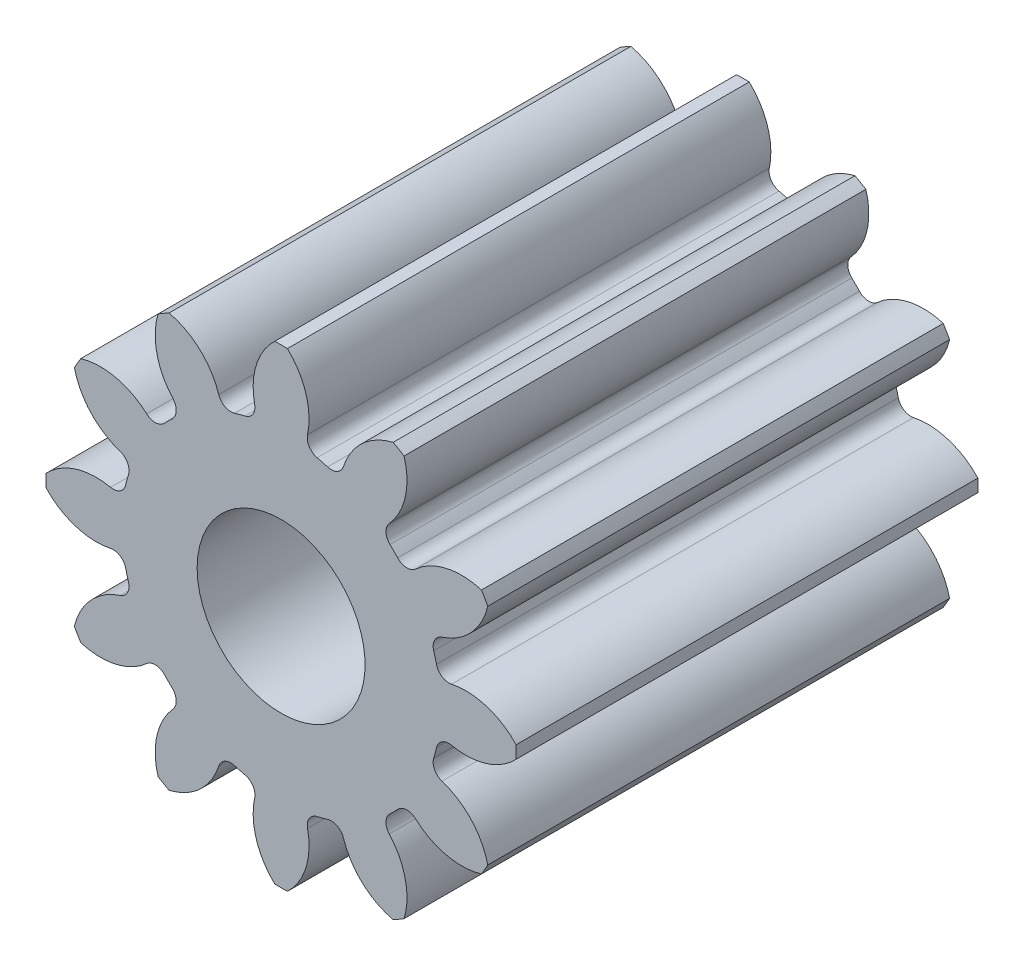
ISO-10303-21;
HEADER;
FILE_DESCRIPTION(('STEP AP214'),'2;1');
FILE_NAME('part.step','',(''),(''),'','','');
FILE_SCHEMA(('AUTOMOTIVE_DESIGN { 1 0 10303 214 1 1 1 1 }'));
ENDSEC;
DATA;
#1=APPLICATION_CONTEXT('core data for automotive mechanical design processes');
#2=APPLICATION_PROTOCOL_DEFINITION('international standard','automotive_design',2000,#1);
#3=PRODUCT_CONTEXT('',#1,'mechanical');
#4=PRODUCT('Part','Part','',(#3));
#5=PRODUCT_RELATED_PRODUCT_CATEGORY('part','',(#4));
#6=PRODUCT_DEFINITION_FORMATION('','',#4);
#7=PRODUCT_DEFINITION_CONTEXT('part definition',#1,'design');
#8=PRODUCT_DEFINITION('design','',#6,#7);
#9=PRODUCT_DEFINITION_SHAPE('','',#8);
#10=(LENGTH_UNIT() NAMED_UNIT(*) SI_UNIT(.MILLI.,.METRE.));
#11=(NAMED_UNIT(*) PLANE_ANGLE_UNIT() SI_UNIT($,.RADIAN.));
#12=(NAMED_UNIT(*) SI_UNIT($,.STERADIAN.) SOLID_ANGLE_UNIT());
#13=UNCERTAINTY_MEASURE_WITH_UNIT(LENGTH_MEASURE(1.E-05),#10,'distance_accuracy_value','');
#14=(GEOMETRIC_REPRESENTATION_CONTEXT(3) GLOBAL_UNCERTAINTY_ASSIGNED_CONTEXT((#13)) GLOBAL_UNIT_ASSIGNED_CONTEXT((#10,
#11,#12)) REPRESENTATION_CONTEXT('',''));
#15=CARTESIAN_POINT('',(0.,0.,0.));
#16=DIRECTION('',(0.,0.,1.));
#17=DIRECTION('',(1.,0.,0.));
#18=AXIS2_PLACEMENT_3D('',#15,#16,#17);
#19=CARTESIAN_POINT('',(0.,0.,5.5));
#20=DIRECTION('',(0.,0.,1.));
#21=DIRECTION('',(1.,0.,0.));
#22=AXIS2_PLACEMENT_3D('',#19,#20,#21);
#23=PLANE('',#22);
#24=CARTESIAN_POINT('',(0.,0.,5.5));
#25=DIRECTION('',(0.,0.,1.));
#26=DIRECTION('',(1.,0.,0.));
#27=AXIS2_PLACEMENT_3D('',#24,#25,#26);
#28=CIRCLE('',#27,1.9);
#29=CARTESIAN_POINT('',(-0.42919878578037,1.85088854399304,5.5));
#30=VERTEX_POINT('',#29);
#31=CARTESIAN_POINT('',(-0.553747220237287,1.81751589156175,5.5));
#32=VERTEX_POINT('',#31);
#33=EDGE_CURVE('E991',#30,#32,#28,.T.);
#34=ORIENTED_EDGE('',*,*,#33,.T.);
#35=CARTESIAN_POINT('',(-0.598046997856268,1.96291716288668,5.5));
#36=DIRECTION('',(0.,0.,-1.));
#37=DIRECTION('',(-0.866025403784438,-0.500000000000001,0.));
#38=AXIS2_PLACEMENT_3D('',#35,#36,#37);
#39=CIRCLE('',#38,0.152);
#40=CARTESIAN_POINT('',(-0.742638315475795,1.91604125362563,5.5));
#41=VERTEX_POINT('',#40);
#42=EDGE_CURVE('E937',#32,#41,#39,.T.);
#43=ORIENTED_EDGE('',*,*,#42,.T.);
#44=CARTESIAN_POINT('',(-1.5234774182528,1.66289643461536,5.5));
#45=DIRECTION('',(0.,0.,1.));
#46=DIRECTION('',(0.866025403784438,0.500000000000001,0.));
#47=AXIS2_PLACEMENT_3D('',#44,#45,#46);
#48=CIRCLE('',#47,0.820848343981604);
#49=CARTESIAN_POINT('',(-1.33428255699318,2.46164377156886,5.5));
#50=VERTEX_POINT('',#49);
#51=EDGE_CURVE('E939',#41,#50,#48,.T.);
#52=ORIENTED_EDGE('',*,*,#51,.T.);
#53=CARTESIAN_POINT('',(0.,0.,5.5));
#54=DIRECTION('',(0.,0.,1.));
#55=DIRECTION('',(0.866025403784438,0.500000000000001,0.));
#56=AXIS2_PLACEMENT_3D('',#53,#54,#55);
#57=CIRCLE('',#56,2.8);
#58=CARTESIAN_POINT('',(-1.46470476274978,2.38634447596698,5.5));
#59=VERTEX_POINT('',#58);
#60=EDGE_CURVE('E941',#50,#59,#57,.T.);
#61=ORIENTED_EDGE('',*,*,#60,.T.);
#62=CARTESIAN_POINT('',(-0.678371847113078,2.15081836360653,5.5));
#63=DIRECTION('',(0.,0.,1.));
#64=DIRECTION('',(0.866025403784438,0.500000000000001,0.));
#65=AXIS2_PLACEMENT_3D('',#62,#63,#64);
#66=CIRCLE('',#65,0.820848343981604);
#67=CARTESIAN_POINT('',(-1.2880212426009,1.60116427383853,5.5));
#68=VERTEX_POINT('',#67);
#69=EDGE_CURVE('E943',#59,#68,#66,.T.);
#70=ORIENTED_EDGE('',*,*,#69,.T.);
#71=CARTESIAN_POINT('',(-1.40091262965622,1.49938247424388,5.5));
#72=DIRECTION('',(0.,0.,-1.));
#73=DIRECTION('',(0.866025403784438,0.500000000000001,0.));
#74=AXIS2_PLACEMENT_3D('',#71,#72,#73);
#75=CIRCLE('',#74,0.152);
#76=CARTESIAN_POINT('',(-1.29714132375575,1.38831710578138,5.5));
#77=VERTEX_POINT('',#76);
#78=EDGE_CURVE('E945',#68,#77,#75,.T.);
#79=ORIENTED_EDGE('',*,*,#78,.T.);
#80=CARTESIAN_POINT('',(0.,0.,5.5));
#81=DIRECTION('',(0.,0.,1.));
#82=DIRECTION('',(0.866025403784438,0.500000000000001,0.));
#83=AXIS2_PLACEMENT_3D('',#80,#81,#82);
#84=CIRCLE('',#83,1.9);
#85=CARTESIAN_POINT('',(-1.38831710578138,1.29714132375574,5.5));
#86=VERTEX_POINT('',#85);
#87=EDGE_CURVE('E947',#77,#86,#84,.T.);
#88=ORIENTED_EDGE('',*,*,#87,.T.);
#89=CARTESIAN_POINT('',(-1.49938247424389,1.40091262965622,5.5));
#90=DIRECTION('',(0.,0.,-1.));
#91=DIRECTION('',(-0.499999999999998,-0.86602540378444,0.));
#92=AXIS2_PLACEMENT_3D('',#89,#90,#91);
#93=CIRCLE('',#92,0.152);
#94=CARTESIAN_POINT('',(-1.60116427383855,1.28802124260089,5.5));
#95=VERTEX_POINT('',#94);
#96=EDGE_CURVE('E895',#86,#95,#93,.T.);
#97=ORIENTED_EDGE('',*,*,#96,.T.);
#98=CARTESIAN_POINT('',(-2.15081836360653,0.678371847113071,5.5));
#99=DIRECTION('',(0.,0.,1.));
#100=DIRECTION('',(0.499999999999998,0.86602540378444,0.));
#101=AXIS2_PLACEMENT_3D('',#98,#99,#100);
#102=CIRCLE('',#101,0.820848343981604);
#103=CARTESIAN_POINT('',(-2.38634447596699,1.46470476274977,5.5));
#104=VERTEX_POINT('',#103);
#105=EDGE_CURVE('E897',#95,#104,#102,.T.);
#106=ORIENTED_EDGE('',*,*,#105,.T.);
#107=CARTESIAN_POINT('',(0.,0.,5.5));
#108=DIRECTION('',(0.,0.,1.));
#109=DIRECTION('',(0.499999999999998,0.86602540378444,0.));
#110=AXIS2_PLACEMENT_3D('',#107,#108,#109);
#111=CIRCLE('',#110,2.8);
#112=CARTESIAN_POINT('',(-2.46164377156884,1.33428255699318,5.5));
#113=VERTEX_POINT('',#112);
#114=EDGE_CURVE('E899',#104,#113,#111,.T.);
#115=ORIENTED_EDGE('',*,*,#114,.T.);
#116=CARTESIAN_POINT('',(-1.66289643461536,1.52347741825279,5.5));
#117=DIRECTION('',(0.,0.,1.));
#118=DIRECTION('',(0.499999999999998,0.86602540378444,0.));
#119=AXIS2_PLACEMENT_3D('',#116,#117,#118);
#120=CIRCLE('',#119,0.820848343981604);
#121=CARTESIAN_POINT('',(-1.91604125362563,0.742638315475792,5.5));
#122=VERTEX_POINT('',#121);
#123=EDGE_CURVE('E901',#113,#122,#120,.T.);
#124=ORIENTED_EDGE('',*,*,#123,.T.);
#125=CARTESIAN_POINT('',(-1.96291716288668,0.598046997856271,5.5));
#126=DIRECTION('',(0.,0.,-1.));
#127=DIRECTION('',(0.499999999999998,0.86602540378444,0.));
#128=AXIS2_PLACEMENT_3D('',#125,#126,#127);
#129=CIRCLE('',#128,0.152);
#130=CARTESIAN_POINT('',(-1.81751589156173,0.553747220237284,5.5));
#131=VERTEX_POINT('',#130);
#132=EDGE_CURVE('E903',#122,#131,#129,.T.);
#133=ORIENTED_EDGE('',*,*,#132,.T.);
#134=CARTESIAN_POINT('',(0.,0.,5.5));
#135=DIRECTION('',(0.,0.,1.));
#136=DIRECTION('',(0.499999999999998,0.86602540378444,0.));
#137=AXIS2_PLACEMENT_3D('',#134,#135,#136);
#138=CIRCLE('',#137,1.9);
#139=CARTESIAN_POINT('',(-1.85088854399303,0.429198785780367,5.5));
#140=VERTEX_POINT('',#139);
#141=EDGE_CURVE('E905',#131,#140,#138,.T.);
#142=ORIENTED_EDGE('',*,*,#141,.T.);
#143=CARTESIAN_POINT('',(-1.99895962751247,0.46353468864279,5.5));
#144=DIRECTION('',(0.,0.,-1.));
#145=DIRECTION('',(0.,-1.,0.));
#146=AXIS2_PLACEMENT_3D('',#143,#144,#145);
#147=CIRCLE('',#146,0.152);
#148=CARTESIAN_POINT('',(-2.03065955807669,0.314876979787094,5.5));
#149=VERTEX_POINT('',#148);
#150=EDGE_CURVE('E853',#140,#149,#147,.T.);
#151=ORIENTED_EDGE('',*,*,#150,.T.);
#152=CARTESIAN_POINT('',(-2.20184926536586,-0.487921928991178,5.5));
#153=DIRECTION('',(0.,0.,1.));
#154=DIRECTION('',(0.,1.,0.));
#155=AXIS2_PLACEMENT_3D('',#152,#153,#154);
#156=CIRCLE('',#155,0.820848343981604);
#157=CARTESIAN_POINT('',(-2.79898731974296,0.0752992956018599,5.5));
#158=VERTEX_POINT('',#157);
#159=EDGE_CURVE('E855',#149,#158,#156,.T.);
#160=ORIENTED_EDGE('',*,*,#159,.T.);
#161=CARTESIAN_POINT('',(0.,0.,5.5));
#162=DIRECTION('',(0.,0.,1.));
#163=DIRECTION('',(0.,1.,0.));
#164=AXIS2_PLACEMENT_3D('',#161,#162,#163);
#165=CIRCLE('',#164,2.8);
#166=CARTESIAN_POINT('',(-2.79898731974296,-0.0752992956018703,5.5));
#167=VERTEX_POINT('',#166);
#168=EDGE_CURVE('E857',#158,#167,#165,.T.);
#169=ORIENTED_EDGE('',*,*,#168,.T.);
#170=CARTESIAN_POINT('',(-2.20184926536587,0.487921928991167,5.5));
#171=DIRECTION('',(0.,0.,1.));
#172=DIRECTION('',(0.,1.,0.));
#173=AXIS2_PLACEMENT_3D('',#170,#171,#172);
#174=CIRCLE('',#173,0.820848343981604);
#175=CARTESIAN_POINT('',(-2.03065955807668,-0.314876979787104,5.5));
#176=VERTEX_POINT('',#175);
#177=EDGE_CURVE('E859',#167,#176,#174,.T.);
#178=ORIENTED_EDGE('',*,*,#177,.T.);
#179=CARTESIAN_POINT('',(-1.99895962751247,-0.463534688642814,5.5));
#180=DIRECTION('',(0.,0.,-1.));
#181=DIRECTION('',(0.,1.,0.));
#182=AXIS2_PLACEMENT_3D('',#179,#180,#181);
#183=CIRCLE('',#182,0.152);
#184=CARTESIAN_POINT('',(-1.85088854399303,-0.429198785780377,5.5));
#185=VERTEX_POINT('',#184);
#186=EDGE_CURVE('E861',#176,#185,#183,.T.);
#187=ORIENTED_EDGE('',*,*,#186,.T.);
#188=CARTESIAN_POINT('',(0.,0.,5.5));
#189=DIRECTION('',(0.,0.,1.));
#190=DIRECTION('',(0.,1.,0.));
#191=AXIS2_PLACEMENT_3D('',#188,#189,#190);
#192=CIRCLE('',#191,1.9);
#193=CARTESIAN_POINT('',(-1.81751589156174,-0.553747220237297,5.5));
#194=VERTEX_POINT('',#193);
#195=EDGE_CURVE('E863',#185,#194,#192,.T.);
#196=ORIENTED_EDGE('',*,*,#195,.T.);
#197=CARTESIAN_POINT('',(-1.96291716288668,-0.598046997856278,5.5));
#198=DIRECTION('',(0.,0.,-1.));
#199=DIRECTION('',(0.500000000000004,-0.866025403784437,0.));
#200=AXIS2_PLACEMENT_3D('',#197,#198,#199);
#201=CIRCLE('',#200,0.152);
#202=CARTESIAN_POINT('',(-1.91604125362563,-0.742638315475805,5.5));
#203=VERTEX_POINT('',#202);
#204=EDGE_CURVE('E811',#194,#203,#201,.T.);
#205=ORIENTED_EDGE('',*,*,#204,.T.);
#206=CARTESIAN_POINT('',(-1.66289643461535,-1.5234774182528,5.5));
#207=DIRECTION('',(0.,0.,1.));
#208=DIRECTION('',(-0.500000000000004,0.866025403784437,0.));
#209=AXIS2_PLACEMENT_3D('',#206,#207,#208);
#210=CIRCLE('',#209,0.820848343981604);
#211=CARTESIAN_POINT('',(-2.46164377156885,-1.3342825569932,5.5));
#212=VERTEX_POINT('',#211);
#213=EDGE_CURVE('E813',#203,#212,#210,.T.);
#214=ORIENTED_EDGE('',*,*,#213,.T.);
#215=CARTESIAN_POINT('',(0.,0.,5.5));
#216=DIRECTION('',(0.,0.,1.));
#217=DIRECTION('',(-0.500000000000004,0.866025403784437,0.));
#218=AXIS2_PLACEMENT_3D('',#215,#216,#217);
#219=CIRCLE('',#218,2.8);
#220=CARTESIAN_POINT('',(-2.38634447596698,-1.46470476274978,5.5));
#221=VERTEX_POINT('',#220);
#222=EDGE_CURVE('E815',#212,#221,#219,.T.);
#223=ORIENTED_EDGE('',*,*,#222,.T.);
#224=CARTESIAN_POINT('',(-2.15081836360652,-0.678371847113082,5.5));
#225=DIRECTION('',(0.,0.,1.));
#226=DIRECTION('',(-0.500000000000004,0.866025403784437,0.));
#227=AXIS2_PLACEMENT_3D('',#224,#225,#226);
#228=CIRCLE('',#227,0.820848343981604);
#229=CARTESIAN_POINT('',(-1.60116427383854,-1.28802124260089,5.5));
#230=VERTEX_POINT('',#229);
#231=EDGE_CURVE('E817',#221,#230,#228,.T.);
#232=ORIENTED_EDGE('',*,*,#231,.T.);
#233=CARTESIAN_POINT('',(-1.49938247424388,-1.40091262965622,5.5));
#234=DIRECTION('',(0.,0.,-1.));
#235=DIRECTION('',(-0.500000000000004,0.866025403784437,0.));
#236=AXIS2_PLACEMENT_3D('',#233,#234,#235);
#237=CIRCLE('',#236,0.152);
#238=CARTESIAN_POINT('',(-1.38831710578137,-1.29714132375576,5.5));
#239=VERTEX_POINT('',#238);
#240=EDGE_CURVE('E819',#230,#239,#237,.T.);
#241=ORIENTED_EDGE('',*,*,#240,.T.);
#242=CARTESIAN_POINT('',(0.,0.,5.5));
#243=DIRECTION('',(0.,0.,1.));
#244=DIRECTION('',(-0.500000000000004,0.866025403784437,0.));
#245=AXIS2_PLACEMENT_3D('',#242,#243,#244);
#246=CIRCLE('',#245,1.9);
#247=CARTESIAN_POINT('',(-1.29714132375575,-1.38831710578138,5.5));
#248=VERTEX_POINT('',#247);
#249=EDGE_CURVE('E821',#239,#248,#246,.T.);
#250=ORIENTED_EDGE('',*,*,#249,.T.);
#251=CARTESIAN_POINT('',(-1.40091262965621,-1.4993824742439,5.5));
#252=DIRECTION('',(0.,0.,-1.));
#253=DIRECTION('',(0.866025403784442,-0.499999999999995,0.));
#254=AXIS2_PLACEMENT_3D('',#251,#252,#253);
#255=CIRCLE('',#254,0.152);
#256=CARTESIAN_POINT('',(-1.28802124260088,-1.60116427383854,5.5));
#257=VERTEX_POINT('',#256);
#258=EDGE_CURVE('E769',#248,#257,#255,.T.);
#259=ORIENTED_EDGE('',*,*,#258,.T.);
#260=CARTESIAN_POINT('',(-0.678371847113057,-2.15081836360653,5.5));
#261=DIRECTION('',(0.,0.,1.));
#262=DIRECTION('',(-0.866025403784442,0.499999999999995,0.));
#263=AXIS2_PLACEMENT_3D('',#260,#261,#262);
#264=CIRCLE('',#263,0.820848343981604);
#265=CARTESIAN_POINT('',(-1.46470476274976,-2.38634447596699,5.5));
#266=VERTEX_POINT('',#265);
#267=EDGE_CURVE('E771',#257,#266,#264,.T.);
#268=ORIENTED_EDGE('',*,*,#267,.T.);
#269=CARTESIAN_POINT('',(0.,0.,5.5));
#270=DIRECTION('',(0.,0.,1.));
#271=DIRECTION('',(-0.866025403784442,0.499999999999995,0.));
#272=AXIS2_PLACEMENT_3D('',#269,#270,#271);
#273=CIRCLE('',#272,2.8);
#274=CARTESIAN_POINT('',(-1.33428255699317,-2.46164377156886,5.5));
#275=VERTEX_POINT('',#274);
#276=EDGE_CURVE('E773',#266,#275,#273,.T.);
#277=ORIENTED_EDGE('',*,*,#276,.T.);
#278=CARTESIAN_POINT('',(-1.52347741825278,-1.66289643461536,5.5));
#279=DIRECTION('',(0.,0.,1.));
#280=DIRECTION('',(-0.866025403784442,0.499999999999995,0.));
#281=AXIS2_PLACEMENT_3D('',#278,#279,#280);
#282=CIRCLE('',#281,0.820848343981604);
#283=CARTESIAN_POINT('',(-0.742638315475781,-1.91604125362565,5.5));
#284=VERTEX_POINT('',#283);
#285=EDGE_CURVE('E775',#275,#284,#282,.T.);
#286=ORIENTED_EDGE('',*,*,#285,.T.);
#287=CARTESIAN_POINT('',(-0.598046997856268,-1.9629171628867,5.5));
#288=DIRECTION('',(0.,0.,-1.));
#289=DIRECTION('',(-0.866025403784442,0.499999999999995,0.));
#290=AXIS2_PLACEMENT_3D('',#287,#288,#289);
#291=CIRCLE('',#290,0.152);
#292=CARTESIAN_POINT('',(-0.553747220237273,-1.81751589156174,5.5));
#293=VERTEX_POINT('',#292);
#294=EDGE_CURVE('E777',#284,#293,#291,.T.);
#295=ORIENTED_EDGE('',*,*,#294,.T.);
#296=CARTESIAN_POINT('',(0.,0.,5.5));
#297=DIRECTION('',(0.,0.,1.));
#298=DIRECTION('',(-0.866025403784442,0.499999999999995,0.));
#299=AXIS2_PLACEMENT_3D('',#296,#297,#298);
#300=CIRCLE('',#299,1.9);
#301=CARTESIAN_POINT('',(-0.429198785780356,-1.85088854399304,5.5));
#302=VERTEX_POINT('',#301);
#303=EDGE_CURVE('E779',#293,#302,#300,.T.);
#304=ORIENTED_EDGE('',*,*,#303,.T.);
#305=CARTESIAN_POINT('',(-0.463534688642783,-1.99895962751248,5.5));
#306=DIRECTION('',(0.,0.,-1.));
#307=DIRECTION('',(1.,0.,0.));
#308=AXIS2_PLACEMENT_3D('',#305,#306,#307);
#309=CIRCLE('',#308,0.152);
#310=CARTESIAN_POINT('',(-0.31487697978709,-2.03065955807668,5.5));
#311=VERTEX_POINT('',#310);
#312=EDGE_CURVE('E727',#302,#311,#309,.T.);
#313=ORIENTED_EDGE('',*,*,#312,.T.);
#314=CARTESIAN_POINT('',(0.487921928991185,-2.20184926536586,5.5));
#315=DIRECTION('',(0.,0.,1.));
#316=DIRECTION('',(-1.,0.,0.));
#317=AXIS2_PLACEMENT_3D('',#314,#315,#316);
#318=CIRCLE('',#317,0.820848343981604);
#319=CARTESIAN_POINT('',(-0.0752992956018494,-2.79898731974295,5.5));
#320=VERTEX_POINT('',#319);
#321=EDGE_CURVE('E729',#311,#320,#318,.T.);
#322=ORIENTED_EDGE('',*,*,#321,.T.);
#323=CARTESIAN_POINT('',(0.,0.,5.5));
#324=DIRECTION('',(0.,0.,1.));
#325=DIRECTION('',(-1.,0.,0.));
#326=AXIS2_PLACEMENT_3D('',#323,#324,#325);
#327=CIRCLE('',#326,2.8);
#328=CARTESIAN_POINT('',(0.0752992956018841,-2.79898731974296,5.5));
#329=VERTEX_POINT('',#328);
#330=EDGE_CURVE('E731',#320,#329,#327,.T.);
#331=ORIENTED_EDGE('',*,*,#330,.T.);
#332=CARTESIAN_POINT('',(-0.487921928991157,-2.20184926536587,5.5));
#333=DIRECTION('',(0.,0.,1.));
#334=DIRECTION('',(-1.,0.,0.));
#335=AXIS2_PLACEMENT_3D('',#332,#333,#334);
#336=CIRCLE('',#335,0.820848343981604);
#337=CARTESIAN_POINT('',(0.314876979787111,-2.03065955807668,5.5));
#338=VERTEX_POINT('',#337);
#339=EDGE_CURVE('E733',#329,#338,#336,.T.);
#340=ORIENTED_EDGE('',*,*,#339,.T.);
#341=CARTESIAN_POINT('',(0.463534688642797,-1.99895962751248,5.5));
#342=DIRECTION('',(0.,0.,-1.));
#343=DIRECTION('',(-1.,0.,0.));
#344=AXIS2_PLACEMENT_3D('',#341,#342,#343);
#345=CIRCLE('',#344,0.152);
#346=CARTESIAN_POINT('',(0.429198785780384,-1.85088854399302,5.5));
#347=VERTEX_POINT('',#346);
#348=EDGE_CURVE('E735',#338,#347,#345,.T.);
#349=ORIENTED_EDGE('',*,*,#348,.T.);
#350=CARTESIAN_POINT('',(0.,0.,5.5));
#351=DIRECTION('',(0.,0.,1.));
#352=DIRECTION('',(-1.,0.,0.));
#353=AXIS2_PLACEMENT_3D('',#350,#351,#352);
#354=CIRCLE('',#353,1.9);
#355=CARTESIAN_POINT('',(0.553747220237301,-1.81751589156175,5.5));
#356=VERTEX_POINT('',#355);
#357=EDGE_CURVE('E737',#347,#356,#354,.T.);
#358=ORIENTED_EDGE('',*,*,#357,.T.);
#359=CARTESIAN_POINT('',(0.598046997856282,-1.96291716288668,5.5));
#360=DIRECTION('',(0.,0.,-1.));
#361=DIRECTION('',(0.866025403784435,0.500000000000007,0.));
#362=AXIS2_PLACEMENT_3D('',#359,#360,#361);
#363=CIRCLE('',#362,0.152);
#364=CARTESIAN_POINT('',(0.742638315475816,-1.91604125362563,5.5));
#365=VERTEX_POINT('',#364);
#366=EDGE_CURVE('E685',#356,#365,#363,.T.);
#367=ORIENTED_EDGE('',*,*,#366,.T.);
#368=CARTESIAN_POINT('',(1.52347741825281,-1.66289643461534,5.5));
#369=DIRECTION('',(0.,0.,1.));
#370=DIRECTION('',(-0.866025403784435,-0.500000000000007,0.));
#371=AXIS2_PLACEMENT_3D('',#368,#369,#370);
#372=CIRCLE('',#371,0.820848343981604);
#373=CARTESIAN_POINT('',(1.33428255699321,-2.46164377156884,5.5));
#374=VERTEX_POINT('',#373);
#375=EDGE_CURVE('E687',#365,#374,#372,.T.);
#376=ORIENTED_EDGE('',*,*,#375,.T.);
#377=CARTESIAN_POINT('',(0.,0.,5.5));
#378=DIRECTION('',(0.,0.,1.));
#379=DIRECTION('',(-0.866025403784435,-0.500000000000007,0.));
#380=AXIS2_PLACEMENT_3D('',#377,#378,#379);
#381=CIRCLE('',#380,2.8);
#382=CARTESIAN_POINT('',(1.46470476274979,-2.38634447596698,5.5));
#383=VERTEX_POINT('',#382);
#384=EDGE_CURVE('E689',#374,#383,#381,.T.);
#385=ORIENTED_EDGE('',*,*,#384,.T.);
#386=CARTESIAN_POINT('',(0.678371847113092,-2.15081836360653,5.5));
#387=DIRECTION('',(0.,0.,1.));
#388=DIRECTION('',(-0.866025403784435,-0.500000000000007,0.));
#389=AXIS2_PLACEMENT_3D('',#386,#387,#388);
#390=CIRCLE('',#389,0.820848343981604);
#391=CARTESIAN_POINT('',(1.28802124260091,-1.60116427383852,5.5));
#392=VERTEX_POINT('',#391);
#393=EDGE_CURVE('E691',#383,#392,#390,.T.);
#394=ORIENTED_EDGE('',*,*,#393,.T.);
#395=CARTESIAN_POINT('',(1.40091262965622,-1.49938247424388,5.5));
#396=DIRECTION('',(0.,0.,-1.));
#397=DIRECTION('',(-0.866025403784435,-0.500000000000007,0.));
#398=AXIS2_PLACEMENT_3D('',#395,#396,#397);
#399=CIRCLE('',#398,0.152);
#400=CARTESIAN_POINT('',(1.29714132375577,-1.38831710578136,5.5));
#401=VERTEX_POINT('',#400);
#402=EDGE_CURVE('E693',#392,#401,#399,.T.);
#403=ORIENTED_EDGE('',*,*,#402,.T.);
#404=CARTESIAN_POINT('',(0.,0.,5.5));
#405=DIRECTION('',(0.,0.,1.));
#406=DIRECTION('',(-0.866025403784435,-0.500000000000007,0.));
#407=AXIS2_PLACEMENT_3D('',#404,#405,#406);
#408=CIRCLE('',#407,1.9);
#409=CARTESIAN_POINT('',(1.3883171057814,-1.29714132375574,5.5));
#410=VERTEX_POINT('',#409);
#411=EDGE_CURVE('E695',#401,#410,#408,.T.);
#412=ORIENTED_EDGE('',*,*,#411,.T.);
#413=CARTESIAN_POINT('',(1.4993824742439,-1.40091262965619,5.5));
#414=DIRECTION('',(0.,0.,-1.));
#415=DIRECTION('',(0.499999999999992,0.866025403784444,0.));
#416=AXIS2_PLACEMENT_3D('',#413,#414,#415);
#417=CIRCLE('',#416,0.152);
#418=CARTESIAN_POINT('',(1.60116427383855,-1.28802124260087,5.5));
#419=VERTEX_POINT('',#418);
#420=EDGE_CURVE('E643',#410,#419,#417,.T.);
#421=ORIENTED_EDGE('',*,*,#420,.T.);
#422=CARTESIAN_POINT('',(2.15081836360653,-0.67837184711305,5.5));
#423=DIRECTION('',(0.,0.,1.));
#424=DIRECTION('',(-0.499999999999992,-0.866025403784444,0.));
#425=AXIS2_PLACEMENT_3D('',#422,#423,#424);
#426=CIRCLE('',#425,0.820848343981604);
#427=CARTESIAN_POINT('',(2.38634447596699,-1.46470476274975,5.5));
#428=VERTEX_POINT('',#427);
#429=EDGE_CURVE('E645',#419,#428,#426,.T.);
#430=ORIENTED_EDGE('',*,*,#429,.T.);
#431=CARTESIAN_POINT('',(0.,0.,5.5));
#432=DIRECTION('',(0.,0.,1.));
#433=DIRECTION('',(-0.499999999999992,-0.866025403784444,0.));
#434=AXIS2_PLACEMENT_3D('',#431,#432,#433);
#435=CIRCLE('',#434,2.8);
#436=CARTESIAN_POINT('',(2.46164377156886,-1.33428255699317,5.5));
#437=VERTEX_POINT('',#436);
#438=EDGE_CURVE('E647',#428,#437,#435,.T.);
#439=ORIENTED_EDGE('',*,*,#438,.T.);
#440=CARTESIAN_POINT('',(1.66289643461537,-1.52347741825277,5.5));
#441=DIRECTION('',(0.,0.,1.));
#442=DIRECTION('',(-0.499999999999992,-0.866025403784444,0.));
#443=AXIS2_PLACEMENT_3D('',#440,#441,#442);
#444=CIRCLE('',#443,0.820848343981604);
#445=CARTESIAN_POINT('',(1.91604125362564,-0.742638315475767,5.5));
#446=VERTEX_POINT('',#445);
#447=EDGE_CURVE('E649',#437,#446,#444,.T.);
#448=ORIENTED_EDGE('',*,*,#447,.T.);
#449=CARTESIAN_POINT('',(1.96291716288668,-0.59804699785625,5.5));
#450=DIRECTION('',(0.,0.,-1.));
#451=DIRECTION('',(-0.499999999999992,-0.866025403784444,0.));
#452=AXIS2_PLACEMENT_3D('',#449,#450,#451);
#453=CIRCLE('',#452,0.152);
#454=CARTESIAN_POINT('',(1.81751589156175,-0.553747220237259,5.5));
#455=VERTEX_POINT('',#454);
#456=EDGE_CURVE('E651',#446,#455,#453,.T.);
#457=ORIENTED_EDGE('',*,*,#456,.T.);
#458=CARTESIAN_POINT('',(0.,0.,5.5));
#459=DIRECTION('',(0.,0.,1.));
#460=DIRECTION('',(-0.499999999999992,-0.866025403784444,0.));
#461=AXIS2_PLACEMENT_3D('',#458,#459,#460);
#462=CIRCLE('',#461,1.9);
#463=CARTESIAN_POINT('',(1.85088854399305,-0.429198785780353,5.5));
#464=VERTEX_POINT('',#463);
#465=EDGE_CURVE('E653',#455,#464,#462,.T.);
#466=ORIENTED_EDGE('',*,*,#465,.T.);
#467=CARTESIAN_POINT('',(1.99895962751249,-0.463534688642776,5.5));
#468=DIRECTION('',(0.,0.,-1.));
#469=DIRECTION('',(0.,1.,0.));
#470=AXIS2_PLACEMENT_3D('',#467,#468,#469);
#471=CIRCLE('',#470,0.152);
#472=CARTESIAN_POINT('',(2.03065955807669,-0.314876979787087,5.5));
#473=VERTEX_POINT('',#472);
#474=EDGE_CURVE('E601',#464,#473,#471,.T.);
#475=ORIENTED_EDGE('',*,*,#474,.T.);
#476=CARTESIAN_POINT('',(2.20184926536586,0.487921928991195,5.5));
#477=DIRECTION('',(0.,0.,1.));
#478=DIRECTION('',(0.,-1.,0.));
#479=AXIS2_PLACEMENT_3D('',#476,#477,#478);
#480=CIRCLE('',#479,0.820848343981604);
#481=CARTESIAN_POINT('',(2.79898731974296,-0.0752992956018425,5.5));
#482=VERTEX_POINT('',#481);
#483=EDGE_CURVE('E603',#473,#482,#480,.T.);
#484=ORIENTED_EDGE('',*,*,#483,.T.);
#485=CARTESIAN_POINT('',(0.,0.,5.5));
#486=DIRECTION('',(0.,0.,1.));
#487=DIRECTION('',(0.,-1.,0.));
#488=AXIS2_PLACEMENT_3D('',#485,#486,#487);
#489=CIRCLE('',#488,2.8);
#490=CARTESIAN_POINT('',(2.79898731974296,0.0752992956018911,5.5));
#491=VERTEX_POINT('',#490);
#492=EDGE_CURVE('E605',#482,#491,#489,.T.);
#493=ORIENTED_EDGE('',*,*,#492,.T.);
#494=CARTESIAN_POINT('',(2.20184926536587,-0.48792192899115,5.5));
#495=DIRECTION('',(0.,0.,1.));
#496=DIRECTION('',(0.,-1.,0.));
#497=AXIS2_PLACEMENT_3D('',#494,#495,#496);
#498=CIRCLE('',#497,0.820848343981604);
#499=CARTESIAN_POINT('',(2.03065955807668,0.314876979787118,5.5));
#500=VERTEX_POINT('',#499);
#501=EDGE_CURVE('E607',#491,#500,#498,.T.);
#502=ORIENTED_EDGE('',*,*,#501,.T.);
#503=CARTESIAN_POINT('',(1.99895962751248,0.463534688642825,5.5));
#504=DIRECTION('',(0.,0.,-1.));
#505=DIRECTION('',(0.,-1.,0.));
#506=AXIS2_PLACEMENT_3D('',#503,#504,#505);
#507=CIRCLE('',#506,0.152);
#508=CARTESIAN_POINT('',(1.85088854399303,0.429198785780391,5.5));
#509=VERTEX_POINT('',#508);
#510=EDGE_CURVE('E609',#500,#509,#507,.T.);
#511=ORIENTED_EDGE('',*,*,#510,.T.);
#512=CARTESIAN_POINT('',(0.,0.,5.5));
#513=DIRECTION('',(0.,0.,1.));
#514=DIRECTION('',(0.,-1.,0.));
#515=AXIS2_PLACEMENT_3D('',#512,#513,#514);
#516=CIRCLE('',#515,1.9);
#517=CARTESIAN_POINT('',(1.81751589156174,0.553747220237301,5.5));
#518=VERTEX_POINT('',#517);
#519=EDGE_CURVE('E611',#509,#518,#516,.T.);
#520=ORIENTED_EDGE('',*,*,#519,.T.);
#521=CARTESIAN_POINT('',(1.96291716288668,0.598046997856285,5.5));
#522=DIRECTION('',(0.,0.,-1.));
#523=DIRECTION('',(-0.50000000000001,0.866025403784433,0.));
#524=AXIS2_PLACEMENT_3D('',#521,#522,#523);
#525=CIRCLE('',#524,0.152);
#526=CARTESIAN_POINT('',(1.91604125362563,0.742638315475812,5.5));
#527=VERTEX_POINT('',#526);
#528=EDGE_CURVE('E498',#518,#527,#525,.T.);
#529=ORIENTED_EDGE('',*,*,#528,.T.);
#530=CARTESIAN_POINT('',(1.66289643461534,1.52347741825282,5.5));
#531=DIRECTION('',(0.,0.,1.));
#532=DIRECTION('',(0.50000000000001,-0.866025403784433,0.));
#533=AXIS2_PLACEMENT_3D('',#530,#531,#532);
#534=CIRCLE('',#533,0.820848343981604);
#535=CARTESIAN_POINT('',(2.46164377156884,1.33428255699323,5.5));
#536=VERTEX_POINT('',#535);
#537=EDGE_CURVE('E563',#527,#536,#534,.T.);
#538=ORIENTED_EDGE('',*,*,#537,.T.);
#539=CARTESIAN_POINT('',(0.,0.,5.5));
#540=DIRECTION('',(0.,0.,1.));
#541=DIRECTION('',(0.50000000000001,-0.866025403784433,0.));
#542=AXIS2_PLACEMENT_3D('',#539,#540,#541);
#543=CIRCLE('',#542,2.8);
#544=CARTESIAN_POINT('',(2.38634447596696,1.46470476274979,5.5));
#545=VERTEX_POINT('',#544);
#546=EDGE_CURVE('E565',#536,#545,#543,.T.);
#547=ORIENTED_EDGE('',*,*,#546,.T.);
#548=CARTESIAN_POINT('',(2.15081836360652,0.678371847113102,5.5));
#549=DIRECTION('',(0.,0.,1.));
#550=DIRECTION('',(0.50000000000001,-0.866025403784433,0.));
#551=AXIS2_PLACEMENT_3D('',#548,#549,#550);
#552=CIRCLE('',#551,0.820848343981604);
#553=CARTESIAN_POINT('',(1.60116427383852,1.28802124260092,5.5));
#554=VERTEX_POINT('',#553);
#555=EDGE_CURVE('E567',#545,#554,#552,.T.);
#556=ORIENTED_EDGE('',*,*,#555,.T.);
#557=CARTESIAN_POINT('',(1.49938247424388,1.40091262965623,5.5));
#558=DIRECTION('',(0.,0.,-1.));
#559=DIRECTION('',(0.50000000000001,-0.866025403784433,0.));
#560=AXIS2_PLACEMENT_3D('',#557,#558,#559);
#561=CIRCLE('',#560,0.152);
#562=CARTESIAN_POINT('',(1.38831710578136,1.29714132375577,5.5));
#563=VERTEX_POINT('',#562);
#564=EDGE_CURVE('E569',#554,#563,#561,.T.);
#565=ORIENTED_EDGE('',*,*,#564,.T.);
#566=CARTESIAN_POINT('',(0.,0.,5.5));
#567=DIRECTION('',(0.,0.,1.));
#568=DIRECTION('',(0.50000000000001,-0.866025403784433,0.));
#569=AXIS2_PLACEMENT_3D('',#566,#567,#568);
#570=CIRCLE('',#569,1.9);
#571=CARTESIAN_POINT('',(1.29714132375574,1.3883171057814,5.5));
#572=VERTEX_POINT('',#571);
#573=EDGE_CURVE('E571',#563,#572,#570,.T.);
#574=ORIENTED_EDGE('',*,*,#573,.T.);
#575=CARTESIAN_POINT('',(1.40091262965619,1.49938247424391,5.5));
#576=DIRECTION('',(0.,0.,-1.));
#577=DIRECTION('',(-0.866025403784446,0.499999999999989,0.));
#578=AXIS2_PLACEMENT_3D('',#575,#576,#577);
#579=CIRCLE('',#578,0.152);
#580=CARTESIAN_POINT('',(1.28802124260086,1.60116427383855,5.5));
#581=VERTEX_POINT('',#580);
#582=EDGE_CURVE('E506',#572,#581,#579,.T.);
#583=ORIENTED_EDGE('',*,*,#582,.T.);
#584=CARTESIAN_POINT('',(0.678371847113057,2.15081836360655,5.5));
#585=DIRECTION('',(0.,0.,1.));
#586=DIRECTION('',(0.866025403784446,-0.499999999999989,0.));
#587=AXIS2_PLACEMENT_3D('',#584,#585,#586);
#588=CIRCLE('',#587,0.820848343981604);
#589=CARTESIAN_POINT('',(1.46470476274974,2.386344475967,5.5));
#590=VERTEX_POINT('',#589);
#591=EDGE_CURVE('E532',#581,#590,#588,.T.);
#592=ORIENTED_EDGE('',*,*,#591,.T.);
#593=CARTESIAN_POINT('',(0.,0.,5.5));
#594=DIRECTION('',(0.,0.,1.));
#595=DIRECTION('',(0.866025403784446,-0.499999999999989,0.));
#596=AXIS2_PLACEMENT_3D('',#593,#594,#595);
#597=CIRCLE('',#596,2.8);
#598=CARTESIAN_POINT('',(1.33428255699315,2.46164377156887,5.5));
#599=VERTEX_POINT('',#598);
#600=EDGE_CURVE('E534',#590,#599,#597,.T.);
#601=ORIENTED_EDGE('',*,*,#600,.T.);
#602=CARTESIAN_POINT('',(1.52347741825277,1.66289643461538,5.5));
#603=DIRECTION('',(0.,0.,1.));
#604=DIRECTION('',(0.866025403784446,-0.499999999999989,0.));
#605=AXIS2_PLACEMENT_3D('',#602,#603,#604);
#606=CIRCLE('',#605,0.820848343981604);
#607=CARTESIAN_POINT('',(0.742638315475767,1.91604125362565,5.5));
#608=VERTEX_POINT('',#607);
#609=EDGE_CURVE('E536',#599,#608,#606,.T.);
#610=ORIENTED_EDGE('',*,*,#609,.T.);
#611=CARTESIAN_POINT('',(0.59804699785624,1.9629171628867,5.5));
#612=DIRECTION('',(0.,0.,-1.));
#613=DIRECTION('',(0.866025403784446,-0.499999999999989,0.));
#614=AXIS2_PLACEMENT_3D('',#611,#612,#613);
#615=CIRCLE('',#614,0.152);
#616=CARTESIAN_POINT('',(0.553747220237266,1.81751589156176,5.5));
#617=VERTEX_POINT('',#616);
#618=EDGE_CURVE('E538',#608,#617,#615,.T.);
#619=ORIENTED_EDGE('',*,*,#618,.T.);
#620=CARTESIAN_POINT('',(0.,0.,5.5));
#621=DIRECTION('',(0.,0.,1.));
#622=DIRECTION('',(1.,0.,0.));
#623=AXIS2_PLACEMENT_3D('',#620,#621,#622);
#624=CIRCLE('',#623,1.9);
#625=CARTESIAN_POINT('',(0.42919878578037,1.85088854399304,5.5));
#626=VERTEX_POINT('',#625);
#627=EDGE_CURVE('E981',#617,#626,#624,.T.);
#628=ORIENTED_EDGE('',*,*,#627,.T.);
#629=CARTESIAN_POINT('',(0.463534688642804,1.99895962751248,5.5));
#630=DIRECTION('',(0.,0.,-1.));
#631=DIRECTION('',(-1.,0.,0.));
#632=AXIS2_PLACEMENT_3D('',#629,#630,#631);
#633=CIRCLE('',#632,0.152);
#634=CARTESIAN_POINT('',(0.31487697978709,2.03065955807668,5.5));
#635=VERTEX_POINT('',#634);
#636=EDGE_CURVE('E983',#626,#635,#633,.T.);
#637=ORIENTED_EDGE('',*,*,#636,.T.);
#638=CARTESIAN_POINT('',(-0.487921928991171,2.20184926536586,5.5));
#639=DIRECTION('',(0.,0.,1.));
#640=DIRECTION('',(1.,0.,0.));
#641=AXIS2_PLACEMENT_3D('',#638,#639,#640);
#642=CIRCLE('',#641,0.820848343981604);
#643=CARTESIAN_POINT('',(0.0752992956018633,2.79898731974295,5.5));
#644=VERTEX_POINT('',#643);
#645=EDGE_CURVE('E985',#635,#644,#642,.T.);
#646=ORIENTED_EDGE('',*,*,#645,.T.);
#647=CARTESIAN_POINT('',(0.,0.,5.5));
#648=DIRECTION('',(0.,0.,1.));
#649=DIRECTION('',(1.,0.,0.));
#650=AXIS2_PLACEMENT_3D('',#647,#648,#649);
#651=CIRCLE('',#650,2.8);
#652=CARTESIAN_POINT('',(-0.0752992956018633,2.79898731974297,5.5));
#653=VERTEX_POINT('',#652);
#654=EDGE_CURVE('E987',#644,#653,#651,.T.);
#655=ORIENTED_EDGE('',*,*,#654,.T.);
#656=CARTESIAN_POINT('',(0.487921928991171,2.20184926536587,5.5));
#657=DIRECTION('',(0.,0.,1.));
#658=DIRECTION('',(1.,0.,0.));
#659=AXIS2_PLACEMENT_3D('',#656,#657,#658);
#660=CIRCLE('',#659,0.820848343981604);
#661=CARTESIAN_POINT('',(-0.314876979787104,2.03065955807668,5.5));
#662=VERTEX_POINT('',#661);
#663=EDGE_CURVE('E58',#653,#662,#660,.T.);
#664=ORIENTED_EDGE('',*,*,#663,.T.);
#665=CARTESIAN_POINT('',(-0.463534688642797,1.99895962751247,5.5));
#666=DIRECTION('',(0.,0.,-1.));
#667=DIRECTION('',(1.,0.,0.));
#668=AXIS2_PLACEMENT_3D('',#665,#666,#667);
#669=CIRCLE('',#668,0.152);
#670=EDGE_CURVE('E53',#662,#30,#669,.T.);
#671=ORIENTED_EDGE('',*,*,#670,.T.);
#672=EDGE_LOOP('',(#34,#43,#52,#61,#70,#79,#88,#97,#106,#115,#124,#133,#142,#151,#160,#169,#178,
#187,#196,#205,#214,#223,#232,#241,#250,#259,#268,#277,#286,#295,#304,#313,#322,#331,#340,#349,
#358,#367,#376,#385,#394,#403,#412,#421,#430,#439,#448,#457,#466,#475,#484,#493,#502,#511,#520,
#529,#538,#547,#556,#565,#574,#583,#592,#601,#610,#619,#628,#637,#646,#655,#664,#671));
#673=FACE_BOUND('',#672,.T.);
#674=CARTESIAN_POINT('',(0.,0.,5.5));
#675=DIRECTION('',(0.,0.,1.));
#676=DIRECTION('',(1.,0.,0.));
#677=AXIS2_PLACEMENT_3D('',#674,#675,#676);
#678=CIRCLE('',#677,1.);
#679=CARTESIAN_POINT('',(-0.999999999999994,0.,5.5));
#680=VERTEX_POINT('',#679);
#681=EDGE_CURVE('E516',#680,#680,#678,.T.);
#682=ORIENTED_EDGE('',*,*,#681,.F.);
#683=EDGE_LOOP('',(#682));
#684=FACE_BOUND('',#683,.T.);
#685=ADVANCED_FACE('F38',(#673,#684),#23,.T.);
#686=CARTESIAN_POINT('',(0.,0.,0.));
#687=DIRECTION('',(0.,0.,1.));
#688=DIRECTION('',(1.,0.,0.));
#689=AXIS2_PLACEMENT_3D('',#686,#687,#688);
#690=PLANE('',#689);
#691=CARTESIAN_POINT('',(-0.598046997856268,1.96291716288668,0.));
#692=DIRECTION('',(0.,0.,-1.));
#693=DIRECTION('',(-0.866025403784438,-0.500000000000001,0.));
#694=AXIS2_PLACEMENT_3D('',#691,#692,#693);
#695=CIRCLE('',#694,0.152);
#696=CARTESIAN_POINT('',(-0.553747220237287,1.81751589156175,0.));
#697=VERTEX_POINT('',#696);
#698=CARTESIAN_POINT('',(-0.742638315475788,1.91604125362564,0.));
#699=VERTEX_POINT('',#698);
#700=EDGE_CURVE('E925',#697,#699,#695,.T.);
#701=ORIENTED_EDGE('',*,*,#700,.F.);
#702=CARTESIAN_POINT('',(0.,0.,0.));
#703=DIRECTION('',(0.,0.,1.));
#704=DIRECTION('',(1.,0.,0.));
#705=AXIS2_PLACEMENT_3D('',#702,#703,#704);
#706=CIRCLE('',#705,1.9);
#707=CARTESIAN_POINT('',(-0.42919878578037,1.85088854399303,0.));
#708=VERTEX_POINT('',#707);
#709=EDGE_CURVE('E979',#708,#697,#706,.T.);
#710=ORIENTED_EDGE('',*,*,#709,.F.);
#711=CARTESIAN_POINT('',(-0.463534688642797,1.99895962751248,0.));
#712=DIRECTION('',(0.,0.,-1.));
#713=DIRECTION('',(1.,0.,0.));
#714=AXIS2_PLACEMENT_3D('',#711,#712,#713);
#715=CIRCLE('',#714,0.152);
#716=CARTESIAN_POINT('',(-0.314876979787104,2.03065955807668,0.));
#717=VERTEX_POINT('',#716);
#718=EDGE_CURVE('E977',#717,#708,#715,.T.);
#719=ORIENTED_EDGE('',*,*,#718,.F.);
#720=CARTESIAN_POINT('',(0.487921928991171,2.20184926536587,0.));
#721=DIRECTION('',(0.,0.,1.));
#722=DIRECTION('',(1.,0.,0.));
#723=AXIS2_PLACEMENT_3D('',#720,#721,#722);
#724=CIRCLE('',#723,0.820848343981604);
#725=CARTESIAN_POINT('',(-0.0752992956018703,2.79898731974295,0.));
#726=VERTEX_POINT('',#725);
#727=EDGE_CURVE('E975',#726,#717,#724,.T.);
#728=ORIENTED_EDGE('',*,*,#727,.F.);
#729=CARTESIAN_POINT('',(0.,0.,0.));
#730=DIRECTION('',(0.,0.,1.));
#731=DIRECTION('',(1.,0.,0.));
#732=AXIS2_PLACEMENT_3D('',#729,#730,#731);
#733=CIRCLE('',#732,2.8);
#734=CARTESIAN_POINT('',(0.0752992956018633,2.79898731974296,0.));
#735=VERTEX_POINT('',#734);
#736=EDGE_CURVE('E973',#735,#726,#733,.T.);
#737=ORIENTED_EDGE('',*,*,#736,.F.);
#738=CARTESIAN_POINT('',(-0.487921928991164,2.20184926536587,0.));
#739=DIRECTION('',(0.,0.,1.));
#740=DIRECTION('',(1.,0.,0.));
#741=AXIS2_PLACEMENT_3D('',#738,#739,#740);
#742=CIRCLE('',#741,0.820848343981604);
#743=CARTESIAN_POINT('',(0.314876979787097,2.03065955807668,0.));
#744=VERTEX_POINT('',#743);
#745=EDGE_CURVE('E971',#744,#735,#742,.T.);
#746=ORIENTED_EDGE('',*,*,#745,.F.);
#747=CARTESIAN_POINT('',(0.46353468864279,1.99895962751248,0.));
#748=DIRECTION('',(0.,0.,-1.));
#749=DIRECTION('',(-1.,0.,0.));
#750=AXIS2_PLACEMENT_3D('',#747,#748,#749);
#751=CIRCLE('',#750,0.152);
#752=CARTESIAN_POINT('',(0.429198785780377,1.85088854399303,0.));
#753=VERTEX_POINT('',#752);
#754=EDGE_CURVE('E969',#753,#744,#751,.T.);
#755=ORIENTED_EDGE('',*,*,#754,.F.);
#756=CARTESIAN_POINT('',(0.,0.,0.));
#757=DIRECTION('',(0.,0.,1.));
#758=DIRECTION('',(1.,0.,0.));
#759=AXIS2_PLACEMENT_3D('',#756,#757,#758);
#760=CIRCLE('',#759,1.9);
#761=CARTESIAN_POINT('',(0.553747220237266,1.81751589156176,0.));
#762=VERTEX_POINT('',#761);
#763=EDGE_CURVE('E967',#762,#753,#760,.T.);
#764=ORIENTED_EDGE('',*,*,#763,.F.);
#765=CARTESIAN_POINT('',(0.598046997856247,1.9629171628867,0.));
#766=DIRECTION('',(0.,0.,-1.));
#767=DIRECTION('',(0.866025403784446,-0.499999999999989,0.));
#768=AXIS2_PLACEMENT_3D('',#765,#766,#767);
#769=CIRCLE('',#768,0.152);
#770=CARTESIAN_POINT('',(0.742638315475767,1.91604125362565,0.));
#771=VERTEX_POINT('',#770);
#772=EDGE_CURVE('E528',#771,#762,#769,.T.);
#773=ORIENTED_EDGE('',*,*,#772,.F.);
#774=CARTESIAN_POINT('',(1.52347741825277,1.66289643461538,0.));
#775=DIRECTION('',(0.,0.,1.));
#776=DIRECTION('',(0.866025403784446,-0.499999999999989,0.));
#777=AXIS2_PLACEMENT_3D('',#774,#775,#776);
#778=CIRCLE('',#777,0.820848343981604);
#779=CARTESIAN_POINT('',(1.33428255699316,2.46164377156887,0.));
#780=VERTEX_POINT('',#779);
#781=EDGE_CURVE('E526',#780,#771,#778,.T.);
#782=ORIENTED_EDGE('',*,*,#781,.F.);
#783=CARTESIAN_POINT('',(0.,0.,0.));
#784=DIRECTION('',(0.,0.,1.));
#785=DIRECTION('',(0.866025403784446,-0.499999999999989,0.));
#786=AXIS2_PLACEMENT_3D('',#783,#784,#785);
#787=CIRCLE('',#786,2.8);
#788=CARTESIAN_POINT('',(1.46470476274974,2.386344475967,0.));
#789=VERTEX_POINT('',#788);
#790=EDGE_CURVE('E518',#789,#780,#787,.T.);
#791=ORIENTED_EDGE('',*,*,#790,.F.);
#792=CARTESIAN_POINT('',(0.678371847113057,2.15081836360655,0.));
#793=DIRECTION('',(0.,0.,1.));
#794=DIRECTION('',(0.866025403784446,-0.499999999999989,0.));
#795=AXIS2_PLACEMENT_3D('',#792,#793,#794);
#796=CIRCLE('',#795,0.820848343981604);
#797=CARTESIAN_POINT('',(1.28802124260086,1.60116427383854,0.));
#798=VERTEX_POINT('',#797);
#799=EDGE_CURVE('E515',#798,#789,#796,.T.);
#800=ORIENTED_EDGE('',*,*,#799,.F.);
#801=CARTESIAN_POINT('',(1.40091262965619,1.49938247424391,0.));
#802=DIRECTION('',(0.,0.,-1.));
#803=DIRECTION('',(-0.866025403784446,0.499999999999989,0.));
#804=AXIS2_PLACEMENT_3D('',#801,#802,#803);
#805=CIRCLE('',#804,0.152);
#806=CARTESIAN_POINT('',(1.29714132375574,1.3883171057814,0.));
#807=VERTEX_POINT('',#806);
#808=EDGE_CURVE('E504',#807,#798,#805,.T.);
#809=ORIENTED_EDGE('',*,*,#808,.F.);
#810=CARTESIAN_POINT('',(0.,0.,0.));
#811=DIRECTION('',(0.,0.,1.));
#812=DIRECTION('',(0.50000000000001,-0.866025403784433,0.));
#813=AXIS2_PLACEMENT_3D('',#810,#811,#812);
#814=CIRCLE('',#813,1.9);
#815=CARTESIAN_POINT('',(1.38831710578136,1.29714132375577,0.));
#816=VERTEX_POINT('',#815);
#817=EDGE_CURVE('E487',#816,#807,#814,.T.);
#818=ORIENTED_EDGE('',*,*,#817,.F.);
#819=CARTESIAN_POINT('',(1.49938247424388,1.40091262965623,0.));
#820=DIRECTION('',(0.,0.,-1.));
#821=DIRECTION('',(0.50000000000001,-0.866025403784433,0.));
#822=AXIS2_PLACEMENT_3D('',#819,#820,#821);
#823=CIRCLE('',#822,0.152);
#824=CARTESIAN_POINT('',(1.60116427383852,1.28802124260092,0.));
#825=VERTEX_POINT('',#824);
#826=EDGE_CURVE('E499',#825,#816,#823,.T.);
#827=ORIENTED_EDGE('',*,*,#826,.F.);
#828=CARTESIAN_POINT('',(2.15081836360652,0.678371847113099,0.));
#829=DIRECTION('',(0.,0.,1.));
#830=DIRECTION('',(0.50000000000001,-0.866025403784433,0.));
#831=AXIS2_PLACEMENT_3D('',#828,#829,#830);
#832=CIRCLE('',#831,0.820848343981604);
#833=CARTESIAN_POINT('',(2.38634447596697,1.46470476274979,0.));
#834=VERTEX_POINT('',#833);
#835=EDGE_CURVE('E559',#834,#825,#832,.T.);
#836=ORIENTED_EDGE('',*,*,#835,.F.);
#837=CARTESIAN_POINT('',(0.,0.,0.));
#838=DIRECTION('',(0.,0.,1.));
#839=DIRECTION('',(0.50000000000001,-0.866025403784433,0.));
#840=AXIS2_PLACEMENT_3D('',#837,#838,#839);
#841=CIRCLE('',#840,2.8);
#842=CARTESIAN_POINT('',(2.46164377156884,1.33428255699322,0.));
#843=VERTEX_POINT('',#842);
#844=EDGE_CURVE('E557',#843,#834,#841,.T.);
#845=ORIENTED_EDGE('',*,*,#844,.F.);
#846=CARTESIAN_POINT('',(1.66289643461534,1.52347741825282,0.));
#847=DIRECTION('',(0.,0.,1.));
#848=DIRECTION('',(0.50000000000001,-0.866025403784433,0.));
#849=AXIS2_PLACEMENT_3D('',#846,#847,#848);
#850=CIRCLE('',#849,0.820848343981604);
#851=CARTESIAN_POINT('',(1.91604125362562,0.742638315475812,0.));
#852=VERTEX_POINT('',#851);
#853=EDGE_CURVE('E555',#852,#843,#850,.T.);
#854=ORIENTED_EDGE('',*,*,#853,.F.);
#855=CARTESIAN_POINT('',(1.96291716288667,0.598046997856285,0.));
#856=DIRECTION('',(0.,0.,-1.));
#857=DIRECTION('',(-0.50000000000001,0.866025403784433,0.));
#858=AXIS2_PLACEMENT_3D('',#855,#856,#857);
#859=CIRCLE('',#858,0.152);
#860=CARTESIAN_POINT('',(1.81751589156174,0.553747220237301,0.));
#861=VERTEX_POINT('',#860);
#862=EDGE_CURVE('E507',#861,#852,#859,.T.);
#863=ORIENTED_EDGE('',*,*,#862,.F.);
#864=CARTESIAN_POINT('',(0.,0.,0.));
#865=DIRECTION('',(0.,0.,1.));
#866=DIRECTION('',(0.,-1.,0.));
#867=AXIS2_PLACEMENT_3D('',#864,#865,#866);
#868=CIRCLE('',#867,1.9);
#869=CARTESIAN_POINT('',(1.85088854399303,0.429198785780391,0.));
#870=VERTEX_POINT('',#869);
#871=EDGE_CURVE('E599',#870,#861,#868,.T.);
#872=ORIENTED_EDGE('',*,*,#871,.F.);
#873=CARTESIAN_POINT('',(1.99895962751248,0.463534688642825,0.));
#874=DIRECTION('',(0.,0.,-1.));
#875=DIRECTION('',(0.,-1.,0.));
#876=AXIS2_PLACEMENT_3D('',#873,#874,#875);
#877=CIRCLE('',#876,0.152);
#878=CARTESIAN_POINT('',(2.03065955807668,0.314876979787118,0.));
#879=VERTEX_POINT('',#878);
#880=EDGE_CURVE('E597',#879,#870,#877,.T.);
#881=ORIENTED_EDGE('',*,*,#880,.F.);
#882=CARTESIAN_POINT('',(2.20184926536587,-0.48792192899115,0.));
#883=DIRECTION('',(0.,0.,1.));
#884=DIRECTION('',(0.,-1.,0.));
#885=AXIS2_PLACEMENT_3D('',#882,#883,#884);
#886=CIRCLE('',#885,0.820848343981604);
#887=CARTESIAN_POINT('',(2.79898731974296,0.0752992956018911,0.));
#888=VERTEX_POINT('',#887);
#889=EDGE_CURVE('E595',#888,#879,#886,.T.);
#890=ORIENTED_EDGE('',*,*,#889,.F.);
#891=CARTESIAN_POINT('',(0.,0.,0.));
#892=DIRECTION('',(0.,0.,1.));
#893=DIRECTION('',(0.,-1.,0.));
#894=AXIS2_PLACEMENT_3D('',#891,#892,#893);
#895=CIRCLE('',#894,2.8);
#896=CARTESIAN_POINT('',(2.79898731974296,-0.0752992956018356,0.));
#897=VERTEX_POINT('',#896);
#898=EDGE_CURVE('E593',#897,#888,#895,.T.);
#899=ORIENTED_EDGE('',*,*,#898,.F.);
#900=CARTESIAN_POINT('',(2.20184926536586,0.487921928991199,0.));
#901=DIRECTION('',(0.,0.,1.));
#902=DIRECTION('',(0.,-1.,0.));
#903=AXIS2_PLACEMENT_3D('',#900,#901,#902);
#904=CIRCLE('',#903,0.820848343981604);
#905=CARTESIAN_POINT('',(2.03065955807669,-0.314876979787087,0.));
#906=VERTEX_POINT('',#905);
#907=EDGE_CURVE('E591',#906,#897,#904,.T.);
#908=ORIENTED_EDGE('',*,*,#907,.F.);
#909=CARTESIAN_POINT('',(1.99895962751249,-0.463534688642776,0.));
#910=DIRECTION('',(0.,0.,-1.));
#911=DIRECTION('',(0.,1.,0.));
#912=AXIS2_PLACEMENT_3D('',#909,#910,#911);
#913=CIRCLE('',#912,0.152);
#914=CARTESIAN_POINT('',(1.85088854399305,-0.429198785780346,0.));
#915=VERTEX_POINT('',#914);
#916=EDGE_CURVE('E589',#915,#906,#913,.T.);
#917=ORIENTED_EDGE('',*,*,#916,.F.);
#918=CARTESIAN_POINT('',(0.,0.,0.));
#919=DIRECTION('',(0.,0.,1.));
#920=DIRECTION('',(-0.499999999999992,-0.866025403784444,0.));
#921=AXIS2_PLACEMENT_3D('',#918,#919,#920);
#922=CIRCLE('',#921,1.9);
#923=CARTESIAN_POINT('',(1.81751589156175,-0.553747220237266,0.));
#924=VERTEX_POINT('',#923);
#925=EDGE_CURVE('E641',#924,#915,#922,.T.);
#926=ORIENTED_EDGE('',*,*,#925,.F.);
#927=CARTESIAN_POINT('',(1.96291716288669,-0.598046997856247,0.));
#928=DIRECTION('',(0.,0.,-1.));
#929=DIRECTION('',(-0.499999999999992,-0.866025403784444,0.));
#930=AXIS2_PLACEMENT_3D('',#927,#928,#929);
#931=CIRCLE('',#930,0.152);
#932=CARTESIAN_POINT('',(1.91604125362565,-0.742638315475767,0.));
#933=VERTEX_POINT('',#932);
#934=EDGE_CURVE('E639',#933,#924,#931,.T.);
#935=ORIENTED_EDGE('',*,*,#934,.F.);
#936=CARTESIAN_POINT('',(1.66289643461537,-1.52347741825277,0.));
#937=DIRECTION('',(0.,0.,1.));
#938=DIRECTION('',(-0.499999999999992,-0.866025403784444,0.));
#939=AXIS2_PLACEMENT_3D('',#936,#937,#938);
#940=CIRCLE('',#939,0.820848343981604);
#941=CARTESIAN_POINT('',(2.46164377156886,-1.33428255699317,0.));
#942=VERTEX_POINT('',#941);
#943=EDGE_CURVE('E637',#942,#933,#940,.T.);
#944=ORIENTED_EDGE('',*,*,#943,.F.);
#945=CARTESIAN_POINT('',(0.,0.,0.));
#946=DIRECTION('',(0.,0.,1.));
#947=DIRECTION('',(-0.499999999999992,-0.866025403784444,0.));
#948=AXIS2_PLACEMENT_3D('',#945,#946,#947);
#949=CIRCLE('',#948,2.8);
#950=CARTESIAN_POINT('',(2.38634447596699,-1.46470476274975,0.));
#951=VERTEX_POINT('',#950);
#952=EDGE_CURVE('E635',#951,#942,#949,.T.);
#953=ORIENTED_EDGE('',*,*,#952,.F.);
#954=CARTESIAN_POINT('',(2.15081836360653,-0.67837184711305,0.));
#955=DIRECTION('',(0.,0.,1.));
#956=DIRECTION('',(-0.499999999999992,-0.866025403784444,0.));
#957=AXIS2_PLACEMENT_3D('',#954,#955,#956);
#958=CIRCLE('',#957,0.820848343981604);
#959=CARTESIAN_POINT('',(1.60116427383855,-1.28802124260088,0.));
#960=VERTEX_POINT('',#959);
#961=EDGE_CURVE('E633',#960,#951,#958,.T.);
#962=ORIENTED_EDGE('',*,*,#961,.F.);
#963=CARTESIAN_POINT('',(1.4993824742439,-1.40091262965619,0.));
#964=DIRECTION('',(0.,0.,-1.));
#965=DIRECTION('',(0.499999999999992,0.866025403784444,0.));
#966=AXIS2_PLACEMENT_3D('',#963,#964,#965);
#967=CIRCLE('',#966,0.152);
#968=CARTESIAN_POINT('',(1.38831710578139,-1.29714132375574,0.));
#969=VERTEX_POINT('',#968);
#970=EDGE_CURVE('E631',#969,#960,#967,.T.);
#971=ORIENTED_EDGE('',*,*,#970,.F.);
#972=CARTESIAN_POINT('',(0.,0.,0.));
#973=DIRECTION('',(0.,0.,1.));
#974=DIRECTION('',(-0.866025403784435,-0.500000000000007,0.));
#975=AXIS2_PLACEMENT_3D('',#972,#973,#974);
#976=CIRCLE('',#975,1.9);
#977=CARTESIAN_POINT('',(1.29714132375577,-1.38831710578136,0.));
#978=VERTEX_POINT('',#977);
#979=EDGE_CURVE('E683',#978,#969,#976,.T.);
#980=ORIENTED_EDGE('',*,*,#979,.F.);
#981=CARTESIAN_POINT('',(1.40091262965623,-1.49938247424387,0.));
#982=DIRECTION('',(0.,0.,-1.));
#983=DIRECTION('',(-0.866025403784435,-0.500000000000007,0.));
#984=AXIS2_PLACEMENT_3D('',#981,#982,#983);
#985=CIRCLE('',#984,0.152);
#986=CARTESIAN_POINT('',(1.28802124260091,-1.60116427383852,0.));
#987=VERTEX_POINT('',#986);
#988=EDGE_CURVE('E681',#987,#978,#985,.T.);
#989=ORIENTED_EDGE('',*,*,#988,.F.);
#990=CARTESIAN_POINT('',(0.678371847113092,-2.15081836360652,0.));
#991=DIRECTION('',(0.,0.,1.));
#992=DIRECTION('',(-0.866025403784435,-0.500000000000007,0.));
#993=AXIS2_PLACEMENT_3D('',#990,#991,#992);
#994=CIRCLE('',#993,0.820848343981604);
#995=CARTESIAN_POINT('',(1.4647047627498,-2.38634447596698,0.));
#996=VERTEX_POINT('',#995);
#997=EDGE_CURVE('E679',#996,#987,#994,.T.);
#998=ORIENTED_EDGE('',*,*,#997,.F.);
#999=CARTESIAN_POINT('',(0.,0.,0.));
#1000=DIRECTION('',(0.,0.,1.));
#1001=DIRECTION('',(-0.866025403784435,-0.500000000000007,0.));
#1002=AXIS2_PLACEMENT_3D('',#999,#1000,#1001);
#1003=CIRCLE('',#1002,2.8);
#1004=CARTESIAN_POINT('',(1.3342825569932,-2.46164377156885,0.));
#1005=VERTEX_POINT('',#1004);
#1006=EDGE_CURVE('E677',#1005,#996,#1003,.T.);
#1007=ORIENTED_EDGE('',*,*,#1006,.F.);
#1008=CARTESIAN_POINT('',(1.5234774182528,-1.66289643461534,0.));
#1009=DIRECTION('',(0.,0.,1.));
#1010=DIRECTION('',(-0.866025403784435,-0.500000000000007,0.));
#1011=AXIS2_PLACEMENT_3D('',#1008,#1009,#1010);
#1012=CIRCLE('',#1011,0.820848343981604);
#1013=CARTESIAN_POINT('',(0.742638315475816,-1.91604125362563,0.));
#1014=VERTEX_POINT('',#1013);
#1015=EDGE_CURVE('E675',#1014,#1005,#1012,.T.);
#1016=ORIENTED_EDGE('',*,*,#1015,.F.);
#1017=CARTESIAN_POINT('',(0.598046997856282,-1.96291716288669,0.));
#1018=DIRECTION('',(0.,0.,-1.));
#1019=DIRECTION('',(0.866025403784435,0.500000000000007,0.));
#1020=AXIS2_PLACEMENT_3D('',#1017,#1018,#1019);
#1021=CIRCLE('',#1020,0.152);
#1022=CARTESIAN_POINT('',(0.553747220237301,-1.81751589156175,0.));
#1023=VERTEX_POINT('',#1022);
#1024=EDGE_CURVE('E673',#1023,#1014,#1021,.T.);
#1025=ORIENTED_EDGE('',*,*,#1024,.F.);
#1026=CARTESIAN_POINT('',(0.,0.,0.));
#1027=DIRECTION('',(0.,0.,1.));
#1028=DIRECTION('',(-1.,0.,0.));
#1029=AXIS2_PLACEMENT_3D('',#1026,#1027,#1028);
#1030=CIRCLE('',#1029,1.9);
#1031=CARTESIAN_POINT('',(0.429198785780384,-1.85088854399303,0.));
#1032=VERTEX_POINT('',#1031);
#1033=EDGE_CURVE('E725',#1032,#1023,#1030,.T.);
#1034=ORIENTED_EDGE('',*,*,#1033,.F.);
#1035=CARTESIAN_POINT('',(0.463534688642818,-1.99895962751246,0.));
#1036=DIRECTION('',(0.,0.,-1.));
#1037=DIRECTION('',(-1.,0.,0.));
#1038=AXIS2_PLACEMENT_3D('',#1035,#1036,#1037);
#1039=CIRCLE('',#1038,0.152);
#1040=CARTESIAN_POINT('',(0.314876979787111,-2.03065955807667,0.));
#1041=VERTEX_POINT('',#1040);
#1042=EDGE_CURVE('E723',#1041,#1032,#1039,.T.);
#1043=ORIENTED_EDGE('',*,*,#1042,.F.);
#1044=CARTESIAN_POINT('',(-0.487921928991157,-2.20184926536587,0.));
#1045=DIRECTION('',(0.,0.,1.));
#1046=DIRECTION('',(-1.,0.,0.));
#1047=AXIS2_PLACEMENT_3D('',#1044,#1045,#1046);
#1048=CIRCLE('',#1047,0.820848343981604);
#1049=CARTESIAN_POINT('',(0.0752992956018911,-2.79898731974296,0.));
#1050=VERTEX_POINT('',#1049);
#1051=EDGE_CURVE('E721',#1050,#1041,#1048,.T.);
#1052=ORIENTED_EDGE('',*,*,#1051,.F.);
#1053=CARTESIAN_POINT('',(0.,0.,0.));
#1054=DIRECTION('',(0.,0.,1.));
#1055=DIRECTION('',(-1.,0.,0.));
#1056=AXIS2_PLACEMENT_3D('',#1053,#1054,#1055);
#1057=CIRCLE('',#1056,2.8);
#1058=CARTESIAN_POINT('',(-0.0752992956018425,-2.79898731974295,0.));
#1059=VERTEX_POINT('',#1058);
#1060=EDGE_CURVE('E719',#1059,#1050,#1057,.T.);
#1061=ORIENTED_EDGE('',*,*,#1060,.F.);
#1062=CARTESIAN_POINT('',(0.487921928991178,-2.20184926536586,0.));
#1063=DIRECTION('',(0.,0.,1.));
#1064=DIRECTION('',(-1.,0.,0.));
#1065=AXIS2_PLACEMENT_3D('',#1062,#1063,#1064);
#1066=CIRCLE('',#1065,0.820848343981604);
#1067=CARTESIAN_POINT('',(-0.31487697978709,-2.03065955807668,0.));
#1068=VERTEX_POINT('',#1067);
#1069=EDGE_CURVE('E717',#1068,#1059,#1066,.T.);
#1070=ORIENTED_EDGE('',*,*,#1069,.F.);
#1071=CARTESIAN_POINT('',(-0.463534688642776,-1.99895962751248,0.));
#1072=DIRECTION('',(0.,0.,-1.));
#1073=DIRECTION('',(1.,0.,0.));
#1074=AXIS2_PLACEMENT_3D('',#1071,#1072,#1073);
#1075=CIRCLE('',#1074,0.152);
#1076=CARTESIAN_POINT('',(-0.429198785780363,-1.85088854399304,0.));
#1077=VERTEX_POINT('',#1076);
#1078=EDGE_CURVE('E715',#1077,#1068,#1075,.T.);
#1079=ORIENTED_EDGE('',*,*,#1078,.F.);
#1080=CARTESIAN_POINT('',(0.,0.,0.));
#1081=DIRECTION('',(0.,0.,1.));
#1082=DIRECTION('',(-0.866025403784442,0.499999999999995,0.));
#1083=AXIS2_PLACEMENT_3D('',#1080,#1081,#1082);
#1084=CIRCLE('',#1083,1.9);
#1085=CARTESIAN_POINT('',(-0.553747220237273,-1.81751589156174,0.));
#1086=VERTEX_POINT('',#1085);
#1087=EDGE_CURVE('E767',#1086,#1077,#1084,.T.);
#1088=ORIENTED_EDGE('',*,*,#1087,.F.);
#1089=CARTESIAN_POINT('',(-0.598046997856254,-1.96291716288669,0.));
#1090=DIRECTION('',(0.,0.,-1.));
#1091=DIRECTION('',(-0.866025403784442,0.499999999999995,0.));
#1092=AXIS2_PLACEMENT_3D('',#1089,#1090,#1091);
#1093=CIRCLE('',#1092,0.152);
#1094=CARTESIAN_POINT('',(-0.742638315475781,-1.91604125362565,0.));
#1095=VERTEX_POINT('',#1094);
#1096=EDGE_CURVE('E765',#1095,#1086,#1093,.T.);
#1097=ORIENTED_EDGE('',*,*,#1096,.F.);
#1098=CARTESIAN_POINT('',(-1.52347741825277,-1.66289643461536,0.));
#1099=DIRECTION('',(0.,0.,1.));
#1100=DIRECTION('',(-0.866025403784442,0.499999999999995,0.));
#1101=AXIS2_PLACEMENT_3D('',#1098,#1099,#1100);
#1102=CIRCLE('',#1101,0.820848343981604);
#1103=CARTESIAN_POINT('',(-1.33428255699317,-2.46164377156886,0.));
#1104=VERTEX_POINT('',#1103);
#1105=EDGE_CURVE('E763',#1104,#1095,#1102,.T.);
#1106=ORIENTED_EDGE('',*,*,#1105,.F.);
#1107=CARTESIAN_POINT('',(0.,0.,0.));
#1108=DIRECTION('',(0.,0.,1.));
#1109=DIRECTION('',(-0.866025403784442,0.499999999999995,0.));
#1110=AXIS2_PLACEMENT_3D('',#1107,#1108,#1109);
#1111=CIRCLE('',#1110,2.8);
#1112=CARTESIAN_POINT('',(-1.46470476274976,-2.386344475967,0.));
#1113=VERTEX_POINT('',#1112);
#1114=EDGE_CURVE('E761',#1113,#1104,#1111,.T.);
#1115=ORIENTED_EDGE('',*,*,#1114,.F.);
#1116=CARTESIAN_POINT('',(-0.678371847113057,-2.15081836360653,0.));
#1117=DIRECTION('',(0.,0.,1.));
#1118=DIRECTION('',(-0.866025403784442,0.499999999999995,0.));
#1119=AXIS2_PLACEMENT_3D('',#1116,#1117,#1118);
#1120=CIRCLE('',#1119,0.820848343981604);
#1121=CARTESIAN_POINT('',(-1.28802124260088,-1.60116427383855,0.));
#1122=VERTEX_POINT('',#1121);
#1123=EDGE_CURVE('E759',#1122,#1113,#1120,.T.);
#1124=ORIENTED_EDGE('',*,*,#1123,.F.);
#1125=CARTESIAN_POINT('',(-1.40091262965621,-1.4993824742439,0.));
#1126=DIRECTION('',(0.,0.,-1.));
#1127=DIRECTION('',(0.866025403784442,-0.499999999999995,0.));
#1128=AXIS2_PLACEMENT_3D('',#1125,#1126,#1127);
#1129=CIRCLE('',#1128,0.152);
#1130=CARTESIAN_POINT('',(-1.29714132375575,-1.38831710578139,0.));
#1131=VERTEX_POINT('',#1130);
#1132=EDGE_CURVE('E757',#1131,#1122,#1129,.T.);
#1133=ORIENTED_EDGE('',*,*,#1132,.F.);
#1134=CARTESIAN_POINT('',(0.,0.,0.));
#1135=DIRECTION('',(0.,0.,1.));
#1136=DIRECTION('',(-0.500000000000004,0.866025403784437,0.));
#1137=AXIS2_PLACEMENT_3D('',#1134,#1135,#1136);
#1138=CIRCLE('',#1137,1.9);
#1139=CARTESIAN_POINT('',(-1.38831710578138,-1.29714132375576,0.));
#1140=VERTEX_POINT('',#1139);
#1141=EDGE_CURVE('E809',#1140,#1131,#1138,.T.);
#1142=ORIENTED_EDGE('',*,*,#1141,.F.);
#1143=CARTESIAN_POINT('',(-1.49938247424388,-1.40091262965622,0.));
#1144=DIRECTION('',(0.,0.,-1.));
#1145=DIRECTION('',(-0.500000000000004,0.866025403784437,0.));
#1146=AXIS2_PLACEMENT_3D('',#1143,#1144,#1145);
#1147=CIRCLE('',#1146,0.152);
#1148=CARTESIAN_POINT('',(-1.60116427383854,-1.28802124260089,0.));
#1149=VERTEX_POINT('',#1148);
#1150=EDGE_CURVE('E807',#1149,#1140,#1147,.T.);
#1151=ORIENTED_EDGE('',*,*,#1150,.F.);
#1152=CARTESIAN_POINT('',(-2.15081836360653,-0.678371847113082,0.));
#1153=DIRECTION('',(0.,0.,1.));
#1154=DIRECTION('',(-0.500000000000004,0.866025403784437,0.));
#1155=AXIS2_PLACEMENT_3D('',#1152,#1153,#1154);
#1156=CIRCLE('',#1155,0.820848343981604);
#1157=CARTESIAN_POINT('',(-2.38634447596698,-1.46470476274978,0.));
#1158=VERTEX_POINT('',#1157);
#1159=EDGE_CURVE('E805',#1158,#1149,#1156,.T.);
#1160=ORIENTED_EDGE('',*,*,#1159,.F.);
#1161=CARTESIAN_POINT('',(0.,0.,0.));
#1162=DIRECTION('',(0.,0.,1.));
#1163=DIRECTION('',(-0.500000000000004,0.866025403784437,0.));
#1164=AXIS2_PLACEMENT_3D('',#1161,#1162,#1163);
#1165=CIRCLE('',#1164,2.8);
#1166=CARTESIAN_POINT('',(-2.46164377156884,-1.3342825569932,0.));
#1167=VERTEX_POINT('',#1166);
#1168=EDGE_CURVE('E803',#1167,#1158,#1165,.T.);
#1169=ORIENTED_EDGE('',*,*,#1168,.F.);
#1170=CARTESIAN_POINT('',(-1.66289643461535,-1.5234774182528,0.));
#1171=DIRECTION('',(0.,0.,1.));
#1172=DIRECTION('',(-0.500000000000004,0.866025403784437,0.));
#1173=AXIS2_PLACEMENT_3D('',#1170,#1171,#1172);
#1174=CIRCLE('',#1173,0.820848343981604);
#1175=CARTESIAN_POINT('',(-1.91604125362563,-0.742638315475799,0.));
#1176=VERTEX_POINT('',#1175);
#1177=EDGE_CURVE('E801',#1176,#1167,#1174,.T.);
#1178=ORIENTED_EDGE('',*,*,#1177,.F.);
#1179=CARTESIAN_POINT('',(-1.96291716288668,-0.598046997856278,0.));
#1180=DIRECTION('',(0.,0.,-1.));
#1181=DIRECTION('',(0.500000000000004,-0.866025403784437,0.));
#1182=AXIS2_PLACEMENT_3D('',#1179,#1180,#1181);
#1183=CIRCLE('',#1182,0.152);
#1184=CARTESIAN_POINT('',(-1.81751589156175,-0.553747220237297,0.));
#1185=VERTEX_POINT('',#1184);
#1186=EDGE_CURVE('E799',#1185,#1176,#1183,.T.);
#1187=ORIENTED_EDGE('',*,*,#1186,.F.);
#1188=CARTESIAN_POINT('',(0.,0.,0.));
#1189=DIRECTION('',(0.,0.,1.));
#1190=DIRECTION('',(0.,1.,0.));
#1191=AXIS2_PLACEMENT_3D('',#1188,#1189,#1190);
#1192=CIRCLE('',#1191,1.9);
#1193=CARTESIAN_POINT('',(-1.85088854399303,-0.429198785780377,0.));
#1194=VERTEX_POINT('',#1193);
#1195=EDGE_CURVE('E851',#1194,#1185,#1192,.T.);
#1196=ORIENTED_EDGE('',*,*,#1195,.F.);
#1197=CARTESIAN_POINT('',(-1.99895962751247,-0.463534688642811,0.));
#1198=DIRECTION('',(0.,0.,-1.));
#1199=DIRECTION('',(0.,1.,0.));
#1200=AXIS2_PLACEMENT_3D('',#1197,#1198,#1199);
#1201=CIRCLE('',#1200,0.152);
#1202=CARTESIAN_POINT('',(-2.03065955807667,-0.314876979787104,0.));
#1203=VERTEX_POINT('',#1202);
#1204=EDGE_CURVE('E849',#1203,#1194,#1201,.T.);
#1205=ORIENTED_EDGE('',*,*,#1204,.F.);
#1206=CARTESIAN_POINT('',(-2.20184926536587,0.487921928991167,0.));
#1207=DIRECTION('',(0.,0.,1.));
#1208=DIRECTION('',(0.,1.,0.));
#1209=AXIS2_PLACEMENT_3D('',#1206,#1207,#1208);
#1210=CIRCLE('',#1209,0.820848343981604);
#1211=CARTESIAN_POINT('',(-2.79898731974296,-0.0752992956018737,0.));
#1212=VERTEX_POINT('',#1211);
#1213=EDGE_CURVE('E847',#1212,#1203,#1210,.T.);
#1214=ORIENTED_EDGE('',*,*,#1213,.F.);
#1215=CARTESIAN_POINT('',(0.,0.,0.));
#1216=DIRECTION('',(0.,0.,1.));
#1217=DIRECTION('',(0.,1.,0.));
#1218=AXIS2_PLACEMENT_3D('',#1215,#1216,#1217);
#1219=CIRCLE('',#1218,2.8);
#1220=CARTESIAN_POINT('',(-2.79898731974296,0.0752992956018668,0.));
#1221=VERTEX_POINT('',#1220);
#1222=EDGE_CURVE('E845',#1221,#1212,#1219,.T.);
#1223=ORIENTED_EDGE('',*,*,#1222,.F.);
#1224=CARTESIAN_POINT('',(-2.20184926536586,-0.487921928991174,0.));
#1225=DIRECTION('',(0.,0.,1.));
#1226=DIRECTION('',(0.,1.,0.));
#1227=AXIS2_PLACEMENT_3D('',#1224,#1225,#1226);
#1228=CIRCLE('',#1227,0.820848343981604);
#1229=CARTESIAN_POINT('',(-2.03065955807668,0.314876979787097,0.));
#1230=VERTEX_POINT('',#1229);
#1231=EDGE_CURVE('E843',#1230,#1221,#1228,.T.);
#1232=ORIENTED_EDGE('',*,*,#1231,.F.);
#1233=CARTESIAN_POINT('',(-1.99895962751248,0.46353468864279,0.));
#1234=DIRECTION('',(0.,0.,-1.));
#1235=DIRECTION('',(0.,-1.,0.));
#1236=AXIS2_PLACEMENT_3D('',#1233,#1234,#1235);
#1237=CIRCLE('',#1236,0.152);
#1238=CARTESIAN_POINT('',(-1.85088854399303,0.429198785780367,0.));
#1239=VERTEX_POINT('',#1238);
#1240=EDGE_CURVE('E841',#1239,#1230,#1237,.T.);
#1241=ORIENTED_EDGE('',*,*,#1240,.F.);
#1242=CARTESIAN_POINT('',(0.,0.,0.));
#1243=DIRECTION('',(0.,0.,1.));
#1244=DIRECTION('',(0.499999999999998,0.86602540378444,0.));
#1245=AXIS2_PLACEMENT_3D('',#1242,#1243,#1244);
#1246=CIRCLE('',#1245,1.9);
#1247=CARTESIAN_POINT('',(-1.81751589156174,0.553747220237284,0.));
#1248=VERTEX_POINT('',#1247);
#1249=EDGE_CURVE('E893',#1248,#1239,#1246,.T.);
#1250=ORIENTED_EDGE('',*,*,#1249,.F.);
#1251=CARTESIAN_POINT('',(-1.96291716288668,0.598046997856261,0.));
#1252=DIRECTION('',(0.,0.,-1.));
#1253=DIRECTION('',(0.499999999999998,0.86602540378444,0.));
#1254=AXIS2_PLACEMENT_3D('',#1251,#1252,#1253);
#1255=CIRCLE('',#1254,0.152);
#1256=CARTESIAN_POINT('',(-1.91604125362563,0.742638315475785,0.));
#1257=VERTEX_POINT('',#1256);
#1258=EDGE_CURVE('E891',#1257,#1248,#1255,.T.);
#1259=ORIENTED_EDGE('',*,*,#1258,.F.);
#1260=CARTESIAN_POINT('',(-1.66289643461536,1.52347741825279,0.));
#1261=DIRECTION('',(0.,0.,1.));
#1262=DIRECTION('',(0.499999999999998,0.86602540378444,0.));
#1263=AXIS2_PLACEMENT_3D('',#1260,#1261,#1262);
#1264=CIRCLE('',#1263,0.820848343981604);
#1265=CARTESIAN_POINT('',(-2.46164377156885,1.33428255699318,0.));
#1266=VERTEX_POINT('',#1265);
#1267=EDGE_CURVE('E889',#1266,#1257,#1264,.T.);
#1268=ORIENTED_EDGE('',*,*,#1267,.F.);
#1269=CARTESIAN_POINT('',(0.,0.,0.));
#1270=DIRECTION('',(0.,0.,1.));
#1271=DIRECTION('',(0.499999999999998,0.86602540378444,0.));
#1272=AXIS2_PLACEMENT_3D('',#1269,#1270,#1271);
#1273=CIRCLE('',#1272,2.8);
#1274=CARTESIAN_POINT('',(-2.38634447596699,1.46470476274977,0.));
#1275=VERTEX_POINT('',#1274);
#1276=EDGE_CURVE('E887',#1275,#1266,#1273,.T.);
#1277=ORIENTED_EDGE('',*,*,#1276,.F.);
#1278=CARTESIAN_POINT('',(-2.15081836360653,0.678371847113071,0.));
#1279=DIRECTION('',(0.,0.,1.));
#1280=DIRECTION('',(0.499999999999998,0.86602540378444,0.));
#1281=AXIS2_PLACEMENT_3D('',#1278,#1279,#1280);
#1282=CIRCLE('',#1281,0.820848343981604);
#1283=CARTESIAN_POINT('',(-1.60116427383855,1.28802124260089,0.));
#1284=VERTEX_POINT('',#1283);
#1285=EDGE_CURVE('E885',#1284,#1275,#1282,.T.);
#1286=ORIENTED_EDGE('',*,*,#1285,.F.);
#1287=CARTESIAN_POINT('',(-1.49938247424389,1.40091262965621,0.));
#1288=DIRECTION('',(0.,0.,-1.));
#1289=DIRECTION('',(-0.499999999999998,-0.86602540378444,0.));
#1290=AXIS2_PLACEMENT_3D('',#1287,#1288,#1289);
#1291=CIRCLE('',#1290,0.152);
#1292=CARTESIAN_POINT('',(-1.38831710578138,1.29714132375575,0.));
#1293=VERTEX_POINT('',#1292);
#1294=EDGE_CURVE('E883',#1293,#1284,#1291,.T.);
#1295=ORIENTED_EDGE('',*,*,#1294,.F.);
#1296=CARTESIAN_POINT('',(0.,0.,0.));
#1297=DIRECTION('',(0.,0.,1.));
#1298=DIRECTION('',(0.866025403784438,0.500000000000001,0.));
#1299=AXIS2_PLACEMENT_3D('',#1296,#1297,#1298);
#1300=CIRCLE('',#1299,1.9);
#1301=CARTESIAN_POINT('',(-1.29714132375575,1.38831710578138,0.));
#1302=VERTEX_POINT('',#1301);
#1303=EDGE_CURVE('E935',#1302,#1293,#1300,.T.);
#1304=ORIENTED_EDGE('',*,*,#1303,.F.);
#1305=CARTESIAN_POINT('',(-1.40091262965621,1.49938247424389,0.));
#1306=DIRECTION('',(0.,0.,-1.));
#1307=DIRECTION('',(0.866025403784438,0.500000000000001,0.));
#1308=AXIS2_PLACEMENT_3D('',#1305,#1306,#1307);
#1309=CIRCLE('',#1308,0.152);
#1310=CARTESIAN_POINT('',(-1.28802124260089,1.60116427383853,0.));
#1311=VERTEX_POINT('',#1310);
#1312=EDGE_CURVE('E933',#1311,#1302,#1309,.T.);
#1313=ORIENTED_EDGE('',*,*,#1312,.F.);
#1314=CARTESIAN_POINT('',(-0.678371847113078,2.15081836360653,0.));
#1315=DIRECTION('',(0.,0.,1.));
#1316=DIRECTION('',(0.866025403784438,0.500000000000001,0.));
#1317=AXIS2_PLACEMENT_3D('',#1314,#1315,#1316);
#1318=CIRCLE('',#1317,0.820848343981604);
#1319=CARTESIAN_POINT('',(-1.46470476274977,2.38634447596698,0.));
#1320=VERTEX_POINT('',#1319);
#1321=EDGE_CURVE('E931',#1320,#1311,#1318,.T.);
#1322=ORIENTED_EDGE('',*,*,#1321,.F.);
#1323=CARTESIAN_POINT('',(0.,0.,0.));
#1324=DIRECTION('',(0.,0.,1.));
#1325=DIRECTION('',(0.866025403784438,0.500000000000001,0.));
#1326=AXIS2_PLACEMENT_3D('',#1323,#1324,#1325);
#1327=CIRCLE('',#1326,2.8);
#1328=CARTESIAN_POINT('',(-1.33428255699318,2.46164377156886,0.));
#1329=VERTEX_POINT('',#1328);
#1330=EDGE_CURVE('E929',#1329,#1320,#1327,.T.);
#1331=ORIENTED_EDGE('',*,*,#1330,.F.);
#1332=CARTESIAN_POINT('',(-1.5234774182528,1.66289643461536,0.));
#1333=DIRECTION('',(0.,0.,1.));
#1334=DIRECTION('',(0.866025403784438,0.500000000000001,0.));
#1335=AXIS2_PLACEMENT_3D('',#1332,#1333,#1334);
#1336=CIRCLE('',#1335,0.820848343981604);
#1337=EDGE_CURVE('E927',#699,#1329,#1336,.T.);
#1338=ORIENTED_EDGE('',*,*,#1337,.F.);
#1339=EDGE_LOOP('',(#701,#710,#719,#728,#737,#746,#755,#764,#773,#782,#791,#800,#809,#818,#827,
#836,#845,#854,#863,#872,#881,#890,#899,#908,#917,#926,#935,#944,#953,#962,#971,#980,#989,#998,
#1007,#1016,#1025,#1034,#1043,#1052,#1061,#1070,#1079,#1088,#1097,#1106,#1115,#1124,#1133,#1142,
#1151,#1160,#1169,#1178,#1187,#1196,#1205,#1214,#1223,#1232,#1241,#1250,#1259,#1268,#1277,#1286,
#1295,#1304,#1313,#1322,#1331,#1338));
#1340=FACE_BOUND('',#1339,.T.);
#1341=CARTESIAN_POINT('',(0.,0.,0.));
#1342=DIRECTION('',(0.,0.,1.));
#1343=DIRECTION('',(1.,0.,0.));
#1344=AXIS2_PLACEMENT_3D('',#1341,#1342,#1343);
#1345=CIRCLE('',#1344,1.);
#1346=CARTESIAN_POINT('',(-0.999999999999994,0.,0.));
#1347=VERTEX_POINT('',#1346);
#1348=EDGE_CURVE('E521',#1347,#1347,#1345,.T.);
#1349=ORIENTED_EDGE('',*,*,#1348,.T.);
#1350=EDGE_LOOP('',(#1349));
#1351=FACE_BOUND('',#1350,.T.);
#1352=ADVANCED_FACE('F512',(#1340,#1351),#690,.F.);
#1353=CARTESIAN_POINT('',(0.,0.,5.5));
#1354=DIRECTION('',(0.,0.,-1.));
#1355=DIRECTION('',(-1.,0.,0.));
#1356=AXIS2_PLACEMENT_3D('',#1353,#1354,#1355);
#1357=CYLINDRICAL_SURFACE('',#1356,1.9);
#1358=ORIENTED_EDGE('',*,*,#763,.T.);
#1359=DIRECTION('',(0.,0.,-1.));
#1360=VECTOR('',#1359,1.);
#1361=CARTESIAN_POINT('',(0.42919878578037,1.85088854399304,5.5));
#1362=LINE('',#1361,#1360);
#1363=EDGE_CURVE('E12',#626,#753,#1362,.T.);
#1364=ORIENTED_EDGE('',*,*,#1363,.F.);
#1365=ORIENTED_EDGE('',*,*,#627,.F.);
#1366=DIRECTION('',(0.,0.,-1.));
#1367=VECTOR('',#1366,1.);
#1368=CARTESIAN_POINT('',(0.553747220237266,1.81751589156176,5.5));
#1369=LINE('',#1368,#1367);
#1370=EDGE_CURVE('E541',#617,#762,#1369,.T.);
#1371=ORIENTED_EDGE('',*,*,#1370,.T.);
#1372=EDGE_LOOP('',(#1358,#1364,#1365,#1371));
#1373=FACE_BOUND('',#1372,.T.);
#1374=ADVANCED_FACE('F40',(#1373),#1357,.T.);
#1375=CARTESIAN_POINT('',(0.463534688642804,1.99895962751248,5.5));
#1376=DIRECTION('',(0.,0.,-1.));
#1377=DIRECTION('',(-1.,0.,0.));
#1378=AXIS2_PLACEMENT_3D('',#1375,#1376,#1377);
#1379=CYLINDRICAL_SURFACE('',#1378,0.152);
#1380=ORIENTED_EDGE('',*,*,#754,.T.);
#1381=DIRECTION('',(0.,0.,-1.));
#1382=VECTOR('',#1381,1.);
#1383=CARTESIAN_POINT('',(0.31487697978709,2.03065955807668,5.5));
#1384=LINE('',#1383,#1382);
#1385=EDGE_CURVE('E46',#635,#744,#1384,.T.);
#1386=ORIENTED_EDGE('',*,*,#1385,.F.);
#1387=ORIENTED_EDGE('',*,*,#636,.F.);
#1388=ORIENTED_EDGE('',*,*,#1363,.T.);
#1389=EDGE_LOOP('',(#1380,#1386,#1387,#1388));
#1390=FACE_BOUND('',#1389,.T.);
#1391=ADVANCED_FACE('F1343',(#1390),#1379,.F.);
#1392=CARTESIAN_POINT('',(-0.487921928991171,2.20184926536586,5.5));
#1393=DIRECTION('',(0.,0.,-1.));
#1394=DIRECTION('',(-1.,0.,0.));
#1395=AXIS2_PLACEMENT_3D('',#1392,#1393,#1394);
#1396=CYLINDRICAL_SURFACE('',#1395,0.820848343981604);
#1397=ORIENTED_EDGE('',*,*,#745,.T.);
#1398=DIRECTION('',(0.,0.,-1.));
#1399=VECTOR('',#1398,1.);
#1400=CARTESIAN_POINT('',(0.0752992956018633,2.79898731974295,5.5));
#1401=LINE('',#1400,#1399);
#1402=EDGE_CURVE('E1002',#644,#735,#1401,.T.);
#1403=ORIENTED_EDGE('',*,*,#1402,.F.);
#1404=ORIENTED_EDGE('',*,*,#645,.F.);
#1405=ORIENTED_EDGE('',*,*,#1385,.T.);
#1406=EDGE_LOOP('',(#1397,#1403,#1404,#1405));
#1407=FACE_BOUND('',#1406,.T.);
#1408=ADVANCED_FACE('F1009',(#1407),#1396,.T.);
#1409=CARTESIAN_POINT('',(0.,0.,5.5));
#1410=DIRECTION('',(0.,0.,-1.));
#1411=DIRECTION('',(-1.,0.,0.));
#1412=AXIS2_PLACEMENT_3D('',#1409,#1410,#1411);
#1413=CYLINDRICAL_SURFACE('',#1412,2.8);
#1414=ORIENTED_EDGE('',*,*,#736,.T.);
#1415=DIRECTION('',(0.,0.,-1.));
#1416=VECTOR('',#1415,1.);
#1417=CARTESIAN_POINT('',(-0.0752992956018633,2.79898731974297,5.5));
#1418=LINE('',#1417,#1416);
#1419=EDGE_CURVE('E999',#653,#726,#1418,.T.);
#1420=ORIENTED_EDGE('',*,*,#1419,.F.);
#1421=ORIENTED_EDGE('',*,*,#654,.F.);
#1422=ORIENTED_EDGE('',*,*,#1402,.T.);
#1423=EDGE_LOOP('',(#1414,#1420,#1421,#1422));
#1424=FACE_BOUND('',#1423,.T.);
#1425=ADVANCED_FACE('F1019',(#1424),#1413,.T.);
#1426=CARTESIAN_POINT('',(0.487921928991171,2.20184926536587,5.5));
#1427=DIRECTION('',(0.,0.,-1.));
#1428=DIRECTION('',(-1.,0.,0.));
#1429=AXIS2_PLACEMENT_3D('',#1426,#1427,#1428);
#1430=CYLINDRICAL_SURFACE('',#1429,0.820848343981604);
#1431=ORIENTED_EDGE('',*,*,#727,.T.);
#1432=DIRECTION('',(0.,0.,-1.));
#1433=VECTOR('',#1432,1.);
#1434=CARTESIAN_POINT('',(-0.314876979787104,2.03065955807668,5.5));
#1435=LINE('',#1434,#1433);
#1436=EDGE_CURVE('E996',#662,#717,#1435,.T.);
#1437=ORIENTED_EDGE('',*,*,#1436,.F.);
#1438=ORIENTED_EDGE('',*,*,#663,.F.);
#1439=ORIENTED_EDGE('',*,*,#1419,.T.);
#1440=EDGE_LOOP('',(#1431,#1437,#1438,#1439));
#1441=FACE_BOUND('',#1440,.T.);
#1442=ADVANCED_FACE('F1022',(#1441),#1430,.T.);
#1443=CARTESIAN_POINT('',(-0.463534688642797,1.99895962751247,5.5));
#1444=DIRECTION('',(0.,0.,-1.));
#1445=DIRECTION('',(-1.,0.,0.));
#1446=AXIS2_PLACEMENT_3D('',#1443,#1444,#1445);
#1447=CYLINDRICAL_SURFACE('',#1446,0.152);
#1448=ORIENTED_EDGE('',*,*,#718,.T.);
#1449=DIRECTION('',(0.,0.,-1.));
#1450=VECTOR('',#1449,1.);
#1451=CARTESIAN_POINT('',(-0.42919878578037,1.85088854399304,5.5));
#1452=LINE('',#1451,#1450);
#1453=EDGE_CURVE('E993',#30,#708,#1452,.T.);
#1454=ORIENTED_EDGE('',*,*,#1453,.F.);
#1455=ORIENTED_EDGE('',*,*,#670,.F.);
#1456=ORIENTED_EDGE('',*,*,#1436,.T.);
#1457=EDGE_LOOP('',(#1448,#1454,#1455,#1456));
#1458=FACE_BOUND('',#1457,.T.);
#1459=ADVANCED_FACE('F1024',(#1458),#1447,.F.);
#1460=CARTESIAN_POINT('',(0.,0.,5.5));
#1461=DIRECTION('',(0.,0.,-1.));
#1462=DIRECTION('',(-1.,0.,0.));
#1463=AXIS2_PLACEMENT_3D('',#1460,#1461,#1462);
#1464=CYLINDRICAL_SURFACE('',#1463,1.9);
#1465=ORIENTED_EDGE('',*,*,#709,.T.);
#1466=DIRECTION('',(0.,0.,-1.));
#1467=VECTOR('',#1466,1.);
#1468=CARTESIAN_POINT('',(-0.553747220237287,1.81751589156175,5.5));
#1469=LINE('',#1468,#1467);
#1470=EDGE_CURVE('E964',#32,#697,#1469,.T.);
#1471=ORIENTED_EDGE('',*,*,#1470,.F.);
#1472=ORIENTED_EDGE('',*,*,#33,.F.);
#1473=ORIENTED_EDGE('',*,*,#1453,.T.);
#1474=EDGE_LOOP('',(#1465,#1471,#1472,#1473));
#1475=FACE_BOUND('',#1474,.T.);
#1476=ADVANCED_FACE('F1029',(#1475),#1464,.T.);
#1477=CARTESIAN_POINT('',(-0.598046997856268,1.96291716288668,5.5));
#1478=DIRECTION('',(0.,0.,-1.));
#1479=DIRECTION('',(-1.,0.,0.));
#1480=AXIS2_PLACEMENT_3D('',#1477,#1478,#1479);
#1481=CYLINDRICAL_SURFACE('',#1480,0.152);
#1482=ORIENTED_EDGE('',*,*,#700,.T.);
#1483=DIRECTION('',(0.,0.,-1.));
#1484=VECTOR('',#1483,1.);
#1485=CARTESIAN_POINT('',(-0.742638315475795,1.91604125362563,5.5));
#1486=LINE('',#1485,#1484);
#1487=EDGE_CURVE('E961',#41,#699,#1486,.T.);
#1488=ORIENTED_EDGE('',*,*,#1487,.F.);
#1489=ORIENTED_EDGE('',*,*,#42,.F.);
#1490=ORIENTED_EDGE('',*,*,#1470,.T.);
#1491=EDGE_LOOP('',(#1482,#1488,#1489,#1490));
#1492=FACE_BOUND('',#1491,.T.);
#1493=ADVANCED_FACE('F1036',(#1492),#1481,.F.);
#1494=CARTESIAN_POINT('',(-1.5234774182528,1.66289643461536,5.5));
#1495=DIRECTION('',(0.,0.,-1.));
#1496=DIRECTION('',(-1.,0.,0.));
#1497=AXIS2_PLACEMENT_3D('',#1494,#1495,#1496);
#1498=CYLINDRICAL_SURFACE('',#1497,0.820848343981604);
#1499=ORIENTED_EDGE('',*,*,#1337,.T.);
#1500=DIRECTION('',(0.,0.,-1.));
#1501=VECTOR('',#1500,1.);
#1502=CARTESIAN_POINT('',(-1.33428255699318,2.46164377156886,5.5));
#1503=LINE('',#1502,#1501);
#1504=EDGE_CURVE('E957',#50,#1329,#1503,.T.);
#1505=ORIENTED_EDGE('',*,*,#1504,.F.);
#1506=ORIENTED_EDGE('',*,*,#51,.F.);
#1507=ORIENTED_EDGE('',*,*,#1487,.T.);
#1508=EDGE_LOOP('',(#1499,#1505,#1506,#1507));
#1509=FACE_BOUND('',#1508,.T.);
#1510=ADVANCED_FACE('F1039',(#1509),#1498,.T.);
#1511=CARTESIAN_POINT('',(0.,0.,5.5));
#1512=DIRECTION('',(0.,0.,-1.));
#1513=DIRECTION('',(-1.,0.,0.));
#1514=AXIS2_PLACEMENT_3D('',#1511,#1512,#1513);
#1515=CYLINDRICAL_SURFACE('',#1514,2.8);
#1516=ORIENTED_EDGE('',*,*,#1330,.T.);
#1517=DIRECTION('',(0.,0.,-1.));
#1518=VECTOR('',#1517,1.);
#1519=CARTESIAN_POINT('',(-1.46470476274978,2.38634447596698,5.5));
#1520=LINE('',#1519,#1518);
#1521=EDGE_CURVE('E955',#59,#1320,#1520,.T.);
#1522=ORIENTED_EDGE('',*,*,#1521,.F.);
#1523=ORIENTED_EDGE('',*,*,#60,.F.);
#1524=ORIENTED_EDGE('',*,*,#1504,.T.);
#1525=EDGE_LOOP('',(#1516,#1522,#1523,#1524));
#1526=FACE_BOUND('',#1525,.T.);
#1527=ADVANCED_FACE('F1044',(#1526),#1515,.T.);
#1528=CARTESIAN_POINT('',(-0.678371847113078,2.15081836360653,5.5));
#1529=DIRECTION('',(0.,0.,-1.));
#1530=DIRECTION('',(-1.,0.,0.));
#1531=AXIS2_PLACEMENT_3D('',#1528,#1529,#1530);
#1532=CYLINDRICAL_SURFACE('',#1531,0.820848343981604);
#1533=ORIENTED_EDGE('',*,*,#1321,.T.);
#1534=DIRECTION('',(0.,0.,-1.));
#1535=VECTOR('',#1534,1.);
#1536=CARTESIAN_POINT('',(-1.2880212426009,1.60116427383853,5.5));
#1537=LINE('',#1536,#1535);
#1538=EDGE_CURVE('E952',#68,#1311,#1537,.T.);
#1539=ORIENTED_EDGE('',*,*,#1538,.F.);
#1540=ORIENTED_EDGE('',*,*,#69,.F.);
#1541=ORIENTED_EDGE('',*,*,#1521,.T.);
#1542=EDGE_LOOP('',(#1533,#1539,#1540,#1541));
#1543=FACE_BOUND('',#1542,.T.);
#1544=ADVANCED_FACE('F1050',(#1543),#1532,.T.);
#1545=CARTESIAN_POINT('',(-1.40091262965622,1.49938247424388,5.5));
#1546=DIRECTION('',(0.,0.,-1.));
#1547=DIRECTION('',(-1.,0.,0.));
#1548=AXIS2_PLACEMENT_3D('',#1545,#1546,#1547);
#1549=CYLINDRICAL_SURFACE('',#1548,0.152);
#1550=ORIENTED_EDGE('',*,*,#1312,.T.);
#1551=DIRECTION('',(0.,0.,-1.));
#1552=VECTOR('',#1551,1.);
#1553=CARTESIAN_POINT('',(-1.29714132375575,1.38831710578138,5.5));
#1554=LINE('',#1553,#1552);
#1555=EDGE_CURVE('E949',#77,#1302,#1554,.T.);
#1556=ORIENTED_EDGE('',*,*,#1555,.F.);
#1557=ORIENTED_EDGE('',*,*,#78,.F.);
#1558=ORIENTED_EDGE('',*,*,#1538,.T.);
#1559=EDGE_LOOP('',(#1550,#1556,#1557,#1558));
#1560=FACE_BOUND('',#1559,.T.);
#1561=ADVANCED_FACE('F1054',(#1560),#1549,.F.);
#1562=CARTESIAN_POINT('',(0.,0.,5.5));
#1563=DIRECTION('',(0.,0.,-1.));
#1564=DIRECTION('',(-1.,0.,0.));
#1565=AXIS2_PLACEMENT_3D('',#1562,#1563,#1564);
#1566=CYLINDRICAL_SURFACE('',#1565,1.9);
#1567=ORIENTED_EDGE('',*,*,#1303,.T.);
#1568=DIRECTION('',(0.,0.,-1.));
#1569=VECTOR('',#1568,1.);
#1570=CARTESIAN_POINT('',(-1.38831710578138,1.29714132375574,5.5));
#1571=LINE('',#1570,#1569);
#1572=EDGE_CURVE('E922',#86,#1293,#1571,.T.);
#1573=ORIENTED_EDGE('',*,*,#1572,.F.);
#1574=ORIENTED_EDGE('',*,*,#87,.F.);
#1575=ORIENTED_EDGE('',*,*,#1555,.T.);
#1576=EDGE_LOOP('',(#1567,#1573,#1574,#1575));
#1577=FACE_BOUND('',#1576,.T.);
#1578=ADVANCED_FACE('F1059',(#1577),#1566,.T.);
#1579=CARTESIAN_POINT('',(-1.49938247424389,1.40091262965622,5.5));
#1580=DIRECTION('',(0.,0.,-1.));
#1581=DIRECTION('',(-1.,0.,0.));
#1582=AXIS2_PLACEMENT_3D('',#1579,#1580,#1581);
#1583=CYLINDRICAL_SURFACE('',#1582,0.152);
#1584=ORIENTED_EDGE('',*,*,#1294,.T.);
#1585=DIRECTION('',(0.,0.,-1.));
#1586=VECTOR('',#1585,1.);
#1587=CARTESIAN_POINT('',(-1.60116427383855,1.28802124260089,5.5));
#1588=LINE('',#1587,#1586);
#1589=EDGE_CURVE('E919',#95,#1284,#1588,.T.);
#1590=ORIENTED_EDGE('',*,*,#1589,.F.);
#1591=ORIENTED_EDGE('',*,*,#96,.F.);
#1592=ORIENTED_EDGE('',*,*,#1572,.T.);
#1593=EDGE_LOOP('',(#1584,#1590,#1591,#1592));
#1594=FACE_BOUND('',#1593,.T.);
#1595=ADVANCED_FACE('F1065',(#1594),#1583,.F.);
#1596=CARTESIAN_POINT('',(-2.15081836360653,0.678371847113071,5.5));
#1597=DIRECTION('',(0.,0.,-1.));
#1598=DIRECTION('',(-1.,0.,0.));
#1599=AXIS2_PLACEMENT_3D('',#1596,#1597,#1598);
#1600=CYLINDRICAL_SURFACE('',#1599,0.820848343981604);
#1601=ORIENTED_EDGE('',*,*,#1285,.T.);
#1602=DIRECTION('',(0.,0.,-1.));
#1603=VECTOR('',#1602,1.);
#1604=CARTESIAN_POINT('',(-2.38634447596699,1.46470476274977,5.5));
#1605=LINE('',#1604,#1603);
#1606=EDGE_CURVE('E916',#104,#1275,#1605,.T.);
#1607=ORIENTED_EDGE('',*,*,#1606,.F.);
#1608=ORIENTED_EDGE('',*,*,#105,.F.);
#1609=ORIENTED_EDGE('',*,*,#1589,.T.);
#1610=EDGE_LOOP('',(#1601,#1607,#1608,#1609));
#1611=FACE_BOUND('',#1610,.T.);
#1612=ADVANCED_FACE('F1069',(#1611),#1600,.T.);
#1613=CARTESIAN_POINT('',(0.,0.,5.5));
#1614=DIRECTION('',(0.,0.,-1.));
#1615=DIRECTION('',(-1.,0.,0.));
#1616=AXIS2_PLACEMENT_3D('',#1613,#1614,#1615);
#1617=CYLINDRICAL_SURFACE('',#1616,2.8);
#1618=ORIENTED_EDGE('',*,*,#1276,.T.);
#1619=DIRECTION('',(0.,0.,-1.));
#1620=VECTOR('',#1619,1.);
#1621=CARTESIAN_POINT('',(-2.46164377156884,1.33428255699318,5.5));
#1622=LINE('',#1621,#1620);
#1623=EDGE_CURVE('E913',#113,#1266,#1622,.T.);
#1624=ORIENTED_EDGE('',*,*,#1623,.F.);
#1625=ORIENTED_EDGE('',*,*,#114,.F.);
#1626=ORIENTED_EDGE('',*,*,#1606,.T.);
#1627=EDGE_LOOP('',(#1618,#1624,#1625,#1626));
#1628=FACE_BOUND('',#1627,.T.);
#1629=ADVANCED_FACE('F1074',(#1628),#1617,.T.);
#1630=CARTESIAN_POINT('',(-1.66289643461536,1.52347741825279,5.5));
#1631=DIRECTION('',(0.,0.,-1.));
#1632=DIRECTION('',(-1.,0.,0.));
#1633=AXIS2_PLACEMENT_3D('',#1630,#1631,#1632);
#1634=CYLINDRICAL_SURFACE('',#1633,0.820848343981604);
#1635=ORIENTED_EDGE('',*,*,#1267,.T.);
#1636=DIRECTION('',(0.,0.,-1.));
#1637=VECTOR('',#1636,1.);
#1638=CARTESIAN_POINT('',(-1.91604125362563,0.742638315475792,5.5));
#1639=LINE('',#1638,#1637);
#1640=EDGE_CURVE('E910',#122,#1257,#1639,.T.);
#1641=ORIENTED_EDGE('',*,*,#1640,.F.);
#1642=ORIENTED_EDGE('',*,*,#123,.F.);
#1643=ORIENTED_EDGE('',*,*,#1623,.T.);
#1644=EDGE_LOOP('',(#1635,#1641,#1642,#1643));
#1645=FACE_BOUND('',#1644,.T.);
#1646=ADVANCED_FACE('F1080',(#1645),#1634,.T.);
#1647=CARTESIAN_POINT('',(-1.96291716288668,0.598046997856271,5.5));
#1648=DIRECTION('',(0.,0.,-1.));
#1649=DIRECTION('',(-1.,0.,0.));
#1650=AXIS2_PLACEMENT_3D('',#1647,#1648,#1649);
#1651=CYLINDRICAL_SURFACE('',#1650,0.152);
#1652=ORIENTED_EDGE('',*,*,#1258,.T.);
#1653=DIRECTION('',(0.,0.,-1.));
#1654=VECTOR('',#1653,1.);
#1655=CARTESIAN_POINT('',(-1.81751589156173,0.553747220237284,5.5));
#1656=LINE('',#1655,#1654);
#1657=EDGE_CURVE('E907',#131,#1248,#1656,.T.);
#1658=ORIENTED_EDGE('',*,*,#1657,.F.);
#1659=ORIENTED_EDGE('',*,*,#132,.F.);
#1660=ORIENTED_EDGE('',*,*,#1640,.T.);
#1661=EDGE_LOOP('',(#1652,#1658,#1659,#1660));
#1662=FACE_BOUND('',#1661,.T.);
#1663=ADVANCED_FACE('F1084',(#1662),#1651,.F.);
#1664=CARTESIAN_POINT('',(0.,0.,5.5));
#1665=DIRECTION('',(0.,0.,-1.));
#1666=DIRECTION('',(-1.,0.,0.));
#1667=AXIS2_PLACEMENT_3D('',#1664,#1665,#1666);
#1668=CYLINDRICAL_SURFACE('',#1667,1.9);
#1669=ORIENTED_EDGE('',*,*,#1249,.T.);
#1670=DIRECTION('',(0.,0.,-1.));
#1671=VECTOR('',#1670,1.);
#1672=CARTESIAN_POINT('',(-1.85088854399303,0.429198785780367,5.5));
#1673=LINE('',#1672,#1671);
#1674=EDGE_CURVE('E880',#140,#1239,#1673,.T.);
#1675=ORIENTED_EDGE('',*,*,#1674,.F.);
#1676=ORIENTED_EDGE('',*,*,#141,.F.);
#1677=ORIENTED_EDGE('',*,*,#1657,.T.);
#1678=EDGE_LOOP('',(#1669,#1675,#1676,#1677));
#1679=FACE_BOUND('',#1678,.T.);
#1680=ADVANCED_FACE('F1089',(#1679),#1668,.T.);
#1681=CARTESIAN_POINT('',(-1.99895962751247,0.46353468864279,5.5));
#1682=DIRECTION('',(0.,0.,-1.));
#1683=DIRECTION('',(-1.,0.,0.));
#1684=AXIS2_PLACEMENT_3D('',#1681,#1682,#1683);
#1685=CYLINDRICAL_SURFACE('',#1684,0.152);
#1686=ORIENTED_EDGE('',*,*,#1240,.T.);
#1687=DIRECTION('',(0.,0.,-1.));
#1688=VECTOR('',#1687,1.);
#1689=CARTESIAN_POINT('',(-2.03065955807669,0.314876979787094,5.5));
#1690=LINE('',#1689,#1688);
#1691=EDGE_CURVE('E877',#149,#1230,#1690,.T.);
#1692=ORIENTED_EDGE('',*,*,#1691,.F.);
#1693=ORIENTED_EDGE('',*,*,#150,.F.);
#1694=ORIENTED_EDGE('',*,*,#1674,.T.);
#1695=EDGE_LOOP('',(#1686,#1692,#1693,#1694));
#1696=FACE_BOUND('',#1695,.T.);
#1697=ADVANCED_FACE('F1095',(#1696),#1685,.F.);
#1698=CARTESIAN_POINT('',(-2.20184926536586,-0.487921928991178,5.5));
#1699=DIRECTION('',(0.,0.,-1.));
#1700=DIRECTION('',(-1.,0.,0.));
#1701=AXIS2_PLACEMENT_3D('',#1698,#1699,#1700);
#1702=CYLINDRICAL_SURFACE('',#1701,0.820848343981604);
#1703=ORIENTED_EDGE('',*,*,#1231,.T.);
#1704=DIRECTION('',(0.,0.,-1.));
#1705=VECTOR('',#1704,1.);
#1706=CARTESIAN_POINT('',(-2.79898731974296,0.0752992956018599,5.5));
#1707=LINE('',#1706,#1705);
#1708=EDGE_CURVE('E874',#158,#1221,#1707,.T.);
#1709=ORIENTED_EDGE('',*,*,#1708,.F.);
#1710=ORIENTED_EDGE('',*,*,#159,.F.);
#1711=ORIENTED_EDGE('',*,*,#1691,.T.);
#1712=EDGE_LOOP('',(#1703,#1709,#1710,#1711));
#1713=FACE_BOUND('',#1712,.T.);
#1714=ADVANCED_FACE('F1099',(#1713),#1702,.T.);
#1715=CARTESIAN_POINT('',(0.,0.,5.5));
#1716=DIRECTION('',(0.,0.,-1.));
#1717=DIRECTION('',(-1.,0.,0.));
#1718=AXIS2_PLACEMENT_3D('',#1715,#1716,#1717);
#1719=CYLINDRICAL_SURFACE('',#1718,2.8);
#1720=ORIENTED_EDGE('',*,*,#1222,.T.);
#1721=DIRECTION('',(0.,0.,-1.));
#1722=VECTOR('',#1721,1.);
#1723=CARTESIAN_POINT('',(-2.79898731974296,-0.0752992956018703,5.5));
#1724=LINE('',#1723,#1722);
#1725=EDGE_CURVE('E871',#167,#1212,#1724,.T.);
#1726=ORIENTED_EDGE('',*,*,#1725,.F.);
#1727=ORIENTED_EDGE('',*,*,#168,.F.);
#1728=ORIENTED_EDGE('',*,*,#1708,.T.);
#1729=EDGE_LOOP('',(#1720,#1726,#1727,#1728));
#1730=FACE_BOUND('',#1729,.T.);
#1731=ADVANCED_FACE('F1104',(#1730),#1719,.T.);
#1732=CARTESIAN_POINT('',(-2.20184926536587,0.487921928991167,5.5));
#1733=DIRECTION('',(0.,0.,-1.));
#1734=DIRECTION('',(-1.,0.,0.));
#1735=AXIS2_PLACEMENT_3D('',#1732,#1733,#1734);
#1736=CYLINDRICAL_SURFACE('',#1735,0.820848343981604);
#1737=ORIENTED_EDGE('',*,*,#1213,.T.);
#1738=DIRECTION('',(0.,0.,-1.));
#1739=VECTOR('',#1738,1.);
#1740=CARTESIAN_POINT('',(-2.03065955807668,-0.314876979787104,5.5));
#1741=LINE('',#1740,#1739);
#1742=EDGE_CURVE('E868',#176,#1203,#1741,.T.);
#1743=ORIENTED_EDGE('',*,*,#1742,.F.);
#1744=ORIENTED_EDGE('',*,*,#177,.F.);
#1745=ORIENTED_EDGE('',*,*,#1725,.T.);
#1746=EDGE_LOOP('',(#1737,#1743,#1744,#1745));
#1747=FACE_BOUND('',#1746,.T.);
#1748=ADVANCED_FACE('F1110',(#1747),#1736,.T.);
#1749=CARTESIAN_POINT('',(-1.99895962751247,-0.463534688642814,5.5));
#1750=DIRECTION('',(0.,0.,-1.));
#1751=DIRECTION('',(-1.,0.,0.));
#1752=AXIS2_PLACEMENT_3D('',#1749,#1750,#1751);
#1753=CYLINDRICAL_SURFACE('',#1752,0.152);
#1754=ORIENTED_EDGE('',*,*,#1204,.T.);
#1755=DIRECTION('',(0.,0.,-1.));
#1756=VECTOR('',#1755,1.);
#1757=CARTESIAN_POINT('',(-1.85088854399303,-0.429198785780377,5.5));
#1758=LINE('',#1757,#1756);
#1759=EDGE_CURVE('E865',#185,#1194,#1758,.T.);
#1760=ORIENTED_EDGE('',*,*,#1759,.F.);
#1761=ORIENTED_EDGE('',*,*,#186,.F.);
#1762=ORIENTED_EDGE('',*,*,#1742,.T.);
#1763=EDGE_LOOP('',(#1754,#1760,#1761,#1762));
#1764=FACE_BOUND('',#1763,.T.);
#1765=ADVANCED_FACE('F1114',(#1764),#1753,.F.);
#1766=CARTESIAN_POINT('',(0.,0.,5.5));
#1767=DIRECTION('',(0.,0.,-1.));
#1768=DIRECTION('',(-1.,0.,0.));
#1769=AXIS2_PLACEMENT_3D('',#1766,#1767,#1768);
#1770=CYLINDRICAL_SURFACE('',#1769,1.9);
#1771=ORIENTED_EDGE('',*,*,#1195,.T.);
#1772=DIRECTION('',(0.,0.,-1.));
#1773=VECTOR('',#1772,1.);
#1774=CARTESIAN_POINT('',(-1.81751589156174,-0.553747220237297,5.5));
#1775=LINE('',#1774,#1773);
#1776=EDGE_CURVE('E838',#194,#1185,#1775,.T.);
#1777=ORIENTED_EDGE('',*,*,#1776,.F.);
#1778=ORIENTED_EDGE('',*,*,#195,.F.);
#1779=ORIENTED_EDGE('',*,*,#1759,.T.);
#1780=EDGE_LOOP('',(#1771,#1777,#1778,#1779));
#1781=FACE_BOUND('',#1780,.T.);
#1782=ADVANCED_FACE('F1119',(#1781),#1770,.T.);
#1783=CARTESIAN_POINT('',(-1.96291716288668,-0.598046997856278,5.5));
#1784=DIRECTION('',(0.,0.,-1.));
#1785=DIRECTION('',(-1.,0.,0.));
#1786=AXIS2_PLACEMENT_3D('',#1783,#1784,#1785);
#1787=CYLINDRICAL_SURFACE('',#1786,0.152);
#1788=ORIENTED_EDGE('',*,*,#1186,.T.);
#1789=DIRECTION('',(0.,0.,-1.));
#1790=VECTOR('',#1789,1.);
#1791=CARTESIAN_POINT('',(-1.91604125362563,-0.742638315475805,5.5));
#1792=LINE('',#1791,#1790);
#1793=EDGE_CURVE('E835',#203,#1176,#1792,.T.);
#1794=ORIENTED_EDGE('',*,*,#1793,.F.);
#1795=ORIENTED_EDGE('',*,*,#204,.F.);
#1796=ORIENTED_EDGE('',*,*,#1776,.T.);
#1797=EDGE_LOOP('',(#1788,#1794,#1795,#1796));
#1798=FACE_BOUND('',#1797,.T.);
#1799=ADVANCED_FACE('F1125',(#1798),#1787,.F.);
#1800=CARTESIAN_POINT('',(-1.66289643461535,-1.5234774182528,5.5));
#1801=DIRECTION('',(0.,0.,-1.));
#1802=DIRECTION('',(-1.,0.,0.));
#1803=AXIS2_PLACEMENT_3D('',#1800,#1801,#1802);
#1804=CYLINDRICAL_SURFACE('',#1803,0.820848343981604);
#1805=ORIENTED_EDGE('',*,*,#1177,.T.);
#1806=DIRECTION('',(0.,0.,-1.));
#1807=VECTOR('',#1806,1.);
#1808=CARTESIAN_POINT('',(-2.46164377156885,-1.3342825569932,5.5));
#1809=LINE('',#1808,#1807);
#1810=EDGE_CURVE('E832',#212,#1167,#1809,.T.);
#1811=ORIENTED_EDGE('',*,*,#1810,.F.);
#1812=ORIENTED_EDGE('',*,*,#213,.F.);
#1813=ORIENTED_EDGE('',*,*,#1793,.T.);
#1814=EDGE_LOOP('',(#1805,#1811,#1812,#1813));
#1815=FACE_BOUND('',#1814,.T.);
#1816=ADVANCED_FACE('F1129',(#1815),#1804,.T.);
#1817=CARTESIAN_POINT('',(0.,0.,5.5));
#1818=DIRECTION('',(0.,0.,-1.));
#1819=DIRECTION('',(-1.,0.,0.));
#1820=AXIS2_PLACEMENT_3D('',#1817,#1818,#1819);
#1821=CYLINDRICAL_SURFACE('',#1820,2.8);
#1822=ORIENTED_EDGE('',*,*,#1168,.T.);
#1823=DIRECTION('',(0.,0.,-1.));
#1824=VECTOR('',#1823,1.);
#1825=CARTESIAN_POINT('',(-2.38634447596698,-1.46470476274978,5.5));
#1826=LINE('',#1825,#1824);
#1827=EDGE_CURVE('E829',#221,#1158,#1826,.T.);
#1828=ORIENTED_EDGE('',*,*,#1827,.F.);
#1829=ORIENTED_EDGE('',*,*,#222,.F.);
#1830=ORIENTED_EDGE('',*,*,#1810,.T.);
#1831=EDGE_LOOP('',(#1822,#1828,#1829,#1830));
#1832=FACE_BOUND('',#1831,.T.);
#1833=ADVANCED_FACE('F1134',(#1832),#1821,.T.);
#1834=CARTESIAN_POINT('',(-2.15081836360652,-0.678371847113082,5.5));
#1835=DIRECTION('',(0.,0.,-1.));
#1836=DIRECTION('',(-1.,0.,0.));
#1837=AXIS2_PLACEMENT_3D('',#1834,#1835,#1836);
#1838=CYLINDRICAL_SURFACE('',#1837,0.820848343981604);
#1839=ORIENTED_EDGE('',*,*,#1159,.T.);
#1840=DIRECTION('',(0.,0.,-1.));
#1841=VECTOR('',#1840,1.);
#1842=CARTESIAN_POINT('',(-1.60116427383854,-1.28802124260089,5.5));
#1843=LINE('',#1842,#1841);
#1844=EDGE_CURVE('E826',#230,#1149,#1843,.T.);
#1845=ORIENTED_EDGE('',*,*,#1844,.F.);
#1846=ORIENTED_EDGE('',*,*,#231,.F.);
#1847=ORIENTED_EDGE('',*,*,#1827,.T.);
#1848=EDGE_LOOP('',(#1839,#1845,#1846,#1847));
#1849=FACE_BOUND('',#1848,.T.);
#1850=ADVANCED_FACE('F1140',(#1849),#1838,.T.);
#1851=CARTESIAN_POINT('',(-1.49938247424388,-1.40091262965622,5.5));
#1852=DIRECTION('',(0.,0.,-1.));
#1853=DIRECTION('',(-1.,0.,0.));
#1854=AXIS2_PLACEMENT_3D('',#1851,#1852,#1853);
#1855=CYLINDRICAL_SURFACE('',#1854,0.152);
#1856=ORIENTED_EDGE('',*,*,#1150,.T.);
#1857=DIRECTION('',(0.,0.,-1.));
#1858=VECTOR('',#1857,1.);
#1859=CARTESIAN_POINT('',(-1.38831710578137,-1.29714132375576,5.5));
#1860=LINE('',#1859,#1858);
#1861=EDGE_CURVE('E823',#239,#1140,#1860,.T.);
#1862=ORIENTED_EDGE('',*,*,#1861,.F.);
#1863=ORIENTED_EDGE('',*,*,#240,.F.);
#1864=ORIENTED_EDGE('',*,*,#1844,.T.);
#1865=EDGE_LOOP('',(#1856,#1862,#1863,#1864));
#1866=FACE_BOUND('',#1865,.T.);
#1867=ADVANCED_FACE('F1144',(#1866),#1855,.F.);
#1868=CARTESIAN_POINT('',(0.,0.,5.5));
#1869=DIRECTION('',(0.,0.,-1.));
#1870=DIRECTION('',(-1.,0.,0.));
#1871=AXIS2_PLACEMENT_3D('',#1868,#1869,#1870);
#1872=CYLINDRICAL_SURFACE('',#1871,1.9);
#1873=ORIENTED_EDGE('',*,*,#1141,.T.);
#1874=DIRECTION('',(0.,0.,-1.));
#1875=VECTOR('',#1874,1.);
#1876=CARTESIAN_POINT('',(-1.29714132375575,-1.38831710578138,5.5));
#1877=LINE('',#1876,#1875);
#1878=EDGE_CURVE('E796',#248,#1131,#1877,.T.);
#1879=ORIENTED_EDGE('',*,*,#1878,.F.);
#1880=ORIENTED_EDGE('',*,*,#249,.F.);
#1881=ORIENTED_EDGE('',*,*,#1861,.T.);
#1882=EDGE_LOOP('',(#1873,#1879,#1880,#1881));
#1883=FACE_BOUND('',#1882,.T.);
#1884=ADVANCED_FACE('F1149',(#1883),#1872,.T.);
#1885=CARTESIAN_POINT('',(-1.40091262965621,-1.4993824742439,5.5));
#1886=DIRECTION('',(0.,0.,-1.));
#1887=DIRECTION('',(-1.,0.,0.));
#1888=AXIS2_PLACEMENT_3D('',#1885,#1886,#1887);
#1889=CYLINDRICAL_SURFACE('',#1888,0.152);
#1890=ORIENTED_EDGE('',*,*,#1132,.T.);
#1891=DIRECTION('',(0.,0.,-1.));
#1892=VECTOR('',#1891,1.);
#1893=CARTESIAN_POINT('',(-1.28802124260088,-1.60116427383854,5.5));
#1894=LINE('',#1893,#1892);
#1895=EDGE_CURVE('E793',#257,#1122,#1894,.T.);
#1896=ORIENTED_EDGE('',*,*,#1895,.F.);
#1897=ORIENTED_EDGE('',*,*,#258,.F.);
#1898=ORIENTED_EDGE('',*,*,#1878,.T.);
#1899=EDGE_LOOP('',(#1890,#1896,#1897,#1898));
#1900=FACE_BOUND('',#1899,.T.);
#1901=ADVANCED_FACE('F1155',(#1900),#1889,.F.);
#1902=CARTESIAN_POINT('',(-0.678371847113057,-2.15081836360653,5.5));
#1903=DIRECTION('',(0.,0.,-1.));
#1904=DIRECTION('',(-1.,0.,0.));
#1905=AXIS2_PLACEMENT_3D('',#1902,#1903,#1904);
#1906=CYLINDRICAL_SURFACE('',#1905,0.820848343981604);
#1907=ORIENTED_EDGE('',*,*,#1123,.T.);
#1908=DIRECTION('',(0.,0.,-1.));
#1909=VECTOR('',#1908,1.);
#1910=CARTESIAN_POINT('',(-1.46470476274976,-2.38634447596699,5.5));
#1911=LINE('',#1910,#1909);
#1912=EDGE_CURVE('E790',#266,#1113,#1911,.T.);
#1913=ORIENTED_EDGE('',*,*,#1912,.F.);
#1914=ORIENTED_EDGE('',*,*,#267,.F.);
#1915=ORIENTED_EDGE('',*,*,#1895,.T.);
#1916=EDGE_LOOP('',(#1907,#1913,#1914,#1915));
#1917=FACE_BOUND('',#1916,.T.);
#1918=ADVANCED_FACE('F1159',(#1917),#1906,.T.);
#1919=CARTESIAN_POINT('',(0.,0.,5.5));
#1920=DIRECTION('',(0.,0.,-1.));
#1921=DIRECTION('',(-1.,0.,0.));
#1922=AXIS2_PLACEMENT_3D('',#1919,#1920,#1921);
#1923=CYLINDRICAL_SURFACE('',#1922,2.8);
#1924=ORIENTED_EDGE('',*,*,#1114,.T.);
#1925=DIRECTION('',(0.,0.,-1.));
#1926=VECTOR('',#1925,1.);
#1927=CARTESIAN_POINT('',(-1.33428255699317,-2.46164377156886,5.5));
#1928=LINE('',#1927,#1926);
#1929=EDGE_CURVE('E787',#275,#1104,#1928,.T.);
#1930=ORIENTED_EDGE('',*,*,#1929,.F.);
#1931=ORIENTED_EDGE('',*,*,#276,.F.);
#1932=ORIENTED_EDGE('',*,*,#1912,.T.);
#1933=EDGE_LOOP('',(#1924,#1930,#1931,#1932));
#1934=FACE_BOUND('',#1933,.T.);
#1935=ADVANCED_FACE('F1164',(#1934),#1923,.T.);
#1936=CARTESIAN_POINT('',(-1.52347741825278,-1.66289643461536,5.5));
#1937=DIRECTION('',(0.,0.,-1.));
#1938=DIRECTION('',(-1.,0.,0.));
#1939=AXIS2_PLACEMENT_3D('',#1936,#1937,#1938);
#1940=CYLINDRICAL_SURFACE('',#1939,0.820848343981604);
#1941=ORIENTED_EDGE('',*,*,#1105,.T.);
#1942=DIRECTION('',(0.,0.,-1.));
#1943=VECTOR('',#1942,1.);
#1944=CARTESIAN_POINT('',(-0.742638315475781,-1.91604125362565,5.5));
#1945=LINE('',#1944,#1943);
#1946=EDGE_CURVE('E784',#284,#1095,#1945,.T.);
#1947=ORIENTED_EDGE('',*,*,#1946,.F.);
#1948=ORIENTED_EDGE('',*,*,#285,.F.);
#1949=ORIENTED_EDGE('',*,*,#1929,.T.);
#1950=EDGE_LOOP('',(#1941,#1947,#1948,#1949));
#1951=FACE_BOUND('',#1950,.T.);
#1952=ADVANCED_FACE('F1170',(#1951),#1940,.T.);
#1953=CARTESIAN_POINT('',(-0.598046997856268,-1.9629171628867,5.5));
#1954=DIRECTION('',(0.,0.,-1.));
#1955=DIRECTION('',(-1.,0.,0.));
#1956=AXIS2_PLACEMENT_3D('',#1953,#1954,#1955);
#1957=CYLINDRICAL_SURFACE('',#1956,0.152);
#1958=ORIENTED_EDGE('',*,*,#1096,.T.);
#1959=DIRECTION('',(0.,0.,-1.));
#1960=VECTOR('',#1959,1.);
#1961=CARTESIAN_POINT('',(-0.553747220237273,-1.81751589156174,5.5));
#1962=LINE('',#1961,#1960);
#1963=EDGE_CURVE('E781',#293,#1086,#1962,.T.);
#1964=ORIENTED_EDGE('',*,*,#1963,.F.);
#1965=ORIENTED_EDGE('',*,*,#294,.F.);
#1966=ORIENTED_EDGE('',*,*,#1946,.T.);
#1967=EDGE_LOOP('',(#1958,#1964,#1965,#1966));
#1968=FACE_BOUND('',#1967,.T.);
#1969=ADVANCED_FACE('F1174',(#1968),#1957,.F.);
#1970=CARTESIAN_POINT('',(0.,0.,5.5));
#1971=DIRECTION('',(0.,0.,-1.));
#1972=DIRECTION('',(-1.,0.,0.));
#1973=AXIS2_PLACEMENT_3D('',#1970,#1971,#1972);
#1974=CYLINDRICAL_SURFACE('',#1973,1.9);
#1975=ORIENTED_EDGE('',*,*,#1087,.T.);
#1976=DIRECTION('',(0.,0.,-1.));
#1977=VECTOR('',#1976,1.);
#1978=CARTESIAN_POINT('',(-0.429198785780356,-1.85088854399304,5.5));
#1979=LINE('',#1978,#1977);
#1980=EDGE_CURVE('E754',#302,#1077,#1979,.T.);
#1981=ORIENTED_EDGE('',*,*,#1980,.F.);
#1982=ORIENTED_EDGE('',*,*,#303,.F.);
#1983=ORIENTED_EDGE('',*,*,#1963,.T.);
#1984=EDGE_LOOP('',(#1975,#1981,#1982,#1983));
#1985=FACE_BOUND('',#1984,.T.);
#1986=ADVANCED_FACE('F1179',(#1985),#1974,.T.);
#1987=CARTESIAN_POINT('',(-0.463534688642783,-1.99895962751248,5.5));
#1988=DIRECTION('',(0.,0.,-1.));
#1989=DIRECTION('',(-1.,0.,0.));
#1990=AXIS2_PLACEMENT_3D('',#1987,#1988,#1989);
#1991=CYLINDRICAL_SURFACE('',#1990,0.152);
#1992=ORIENTED_EDGE('',*,*,#1078,.T.);
#1993=DIRECTION('',(0.,0.,-1.));
#1994=VECTOR('',#1993,1.);
#1995=CARTESIAN_POINT('',(-0.31487697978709,-2.03065955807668,5.5));
#1996=LINE('',#1995,#1994);
#1997=EDGE_CURVE('E751',#311,#1068,#1996,.T.);
#1998=ORIENTED_EDGE('',*,*,#1997,.F.);
#1999=ORIENTED_EDGE('',*,*,#312,.F.);
#2000=ORIENTED_EDGE('',*,*,#1980,.T.);
#2001=EDGE_LOOP('',(#1992,#1998,#1999,#2000));
#2002=FACE_BOUND('',#2001,.T.);
#2003=ADVANCED_FACE('F1185',(#2002),#1991,.F.);
#2004=CARTESIAN_POINT('',(0.487921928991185,-2.20184926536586,5.5));
#2005=DIRECTION('',(0.,0.,-1.));
#2006=DIRECTION('',(-1.,0.,0.));
#2007=AXIS2_PLACEMENT_3D('',#2004,#2005,#2006);
#2008=CYLINDRICAL_SURFACE('',#2007,0.820848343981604);
#2009=ORIENTED_EDGE('',*,*,#1069,.T.);
#2010=DIRECTION('',(0.,0.,-1.));
#2011=VECTOR('',#2010,1.);
#2012=CARTESIAN_POINT('',(-0.0752992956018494,-2.79898731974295,5.5));
#2013=LINE('',#2012,#2011);
#2014=EDGE_CURVE('E748',#320,#1059,#2013,.T.);
#2015=ORIENTED_EDGE('',*,*,#2014,.F.);
#2016=ORIENTED_EDGE('',*,*,#321,.F.);
#2017=ORIENTED_EDGE('',*,*,#1997,.T.);
#2018=EDGE_LOOP('',(#2009,#2015,#2016,#2017));
#2019=FACE_BOUND('',#2018,.T.);
#2020=ADVANCED_FACE('F1189',(#2019),#2008,.T.);
#2021=CARTESIAN_POINT('',(0.,0.,5.5));
#2022=DIRECTION('',(0.,0.,-1.));
#2023=DIRECTION('',(-1.,0.,0.));
#2024=AXIS2_PLACEMENT_3D('',#2021,#2022,#2023);
#2025=CYLINDRICAL_SURFACE('',#2024,2.8);
#2026=ORIENTED_EDGE('',*,*,#1060,.T.);
#2027=DIRECTION('',(0.,0.,-1.));
#2028=VECTOR('',#2027,1.);
#2029=CARTESIAN_POINT('',(0.0752992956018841,-2.79898731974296,5.5));
#2030=LINE('',#2029,#2028);
#2031=EDGE_CURVE('E745',#329,#1050,#2030,.T.);
#2032=ORIENTED_EDGE('',*,*,#2031,.F.);
#2033=ORIENTED_EDGE('',*,*,#330,.F.);
#2034=ORIENTED_EDGE('',*,*,#2014,.T.);
#2035=EDGE_LOOP('',(#2026,#2032,#2033,#2034));
#2036=FACE_BOUND('',#2035,.T.);
#2037=ADVANCED_FACE('F1194',(#2036),#2025,.T.);
#2038=CARTESIAN_POINT('',(-0.487921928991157,-2.20184926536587,5.5));
#2039=DIRECTION('',(0.,0.,-1.));
#2040=DIRECTION('',(-1.,0.,0.));
#2041=AXIS2_PLACEMENT_3D('',#2038,#2039,#2040);
#2042=CYLINDRICAL_SURFACE('',#2041,0.820848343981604);
#2043=ORIENTED_EDGE('',*,*,#1051,.T.);
#2044=DIRECTION('',(0.,0.,-1.));
#2045=VECTOR('',#2044,1.);
#2046=CARTESIAN_POINT('',(0.314876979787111,-2.03065955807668,5.5));
#2047=LINE('',#2046,#2045);
#2048=EDGE_CURVE('E742',#338,#1041,#2047,.T.);
#2049=ORIENTED_EDGE('',*,*,#2048,.F.);
#2050=ORIENTED_EDGE('',*,*,#339,.F.);
#2051=ORIENTED_EDGE('',*,*,#2031,.T.);
#2052=EDGE_LOOP('',(#2043,#2049,#2050,#2051));
#2053=FACE_BOUND('',#2052,.T.);
#2054=ADVANCED_FACE('F1200',(#2053),#2042,.T.);
#2055=CARTESIAN_POINT('',(0.463534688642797,-1.99895962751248,5.5));
#2056=DIRECTION('',(0.,0.,-1.));
#2057=DIRECTION('',(-1.,0.,0.));
#2058=AXIS2_PLACEMENT_3D('',#2055,#2056,#2057);
#2059=CYLINDRICAL_SURFACE('',#2058,0.152);
#2060=ORIENTED_EDGE('',*,*,#1042,.T.);
#2061=DIRECTION('',(0.,0.,-1.));
#2062=VECTOR('',#2061,1.);
#2063=CARTESIAN_POINT('',(0.429198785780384,-1.85088854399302,5.5));
#2064=LINE('',#2063,#2062);
#2065=EDGE_CURVE('E739',#347,#1032,#2064,.T.);
#2066=ORIENTED_EDGE('',*,*,#2065,.F.);
#2067=ORIENTED_EDGE('',*,*,#348,.F.);
#2068=ORIENTED_EDGE('',*,*,#2048,.T.);
#2069=EDGE_LOOP('',(#2060,#2066,#2067,#2068));
#2070=FACE_BOUND('',#2069,.T.);
#2071=ADVANCED_FACE('F1204',(#2070),#2059,.F.);
#2072=CARTESIAN_POINT('',(0.,0.,5.5));
#2073=DIRECTION('',(0.,0.,-1.));
#2074=DIRECTION('',(-1.,0.,0.));
#2075=AXIS2_PLACEMENT_3D('',#2072,#2073,#2074);
#2076=CYLINDRICAL_SURFACE('',#2075,1.9);
#2077=ORIENTED_EDGE('',*,*,#1033,.T.);
#2078=DIRECTION('',(0.,0.,-1.));
#2079=VECTOR('',#2078,1.);
#2080=CARTESIAN_POINT('',(0.553747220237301,-1.81751589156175,5.5));
#2081=LINE('',#2080,#2079);
#2082=EDGE_CURVE('E712',#356,#1023,#2081,.T.);
#2083=ORIENTED_EDGE('',*,*,#2082,.F.);
#2084=ORIENTED_EDGE('',*,*,#357,.F.);
#2085=ORIENTED_EDGE('',*,*,#2065,.T.);
#2086=EDGE_LOOP('',(#2077,#2083,#2084,#2085));
#2087=FACE_BOUND('',#2086,.T.);
#2088=ADVANCED_FACE('F1209',(#2087),#2076,.T.);
#2089=CARTESIAN_POINT('',(0.598046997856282,-1.96291716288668,5.5));
#2090=DIRECTION('',(0.,0.,-1.));
#2091=DIRECTION('',(-1.,0.,0.));
#2092=AXIS2_PLACEMENT_3D('',#2089,#2090,#2091);
#2093=CYLINDRICAL_SURFACE('',#2092,0.152);
#2094=ORIENTED_EDGE('',*,*,#1024,.T.);
#2095=DIRECTION('',(0.,0.,-1.));
#2096=VECTOR('',#2095,1.);
#2097=CARTESIAN_POINT('',(0.742638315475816,-1.91604125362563,5.5));
#2098=LINE('',#2097,#2096);
#2099=EDGE_CURVE('E709',#365,#1014,#2098,.T.);
#2100=ORIENTED_EDGE('',*,*,#2099,.F.);
#2101=ORIENTED_EDGE('',*,*,#366,.F.);
#2102=ORIENTED_EDGE('',*,*,#2082,.T.);
#2103=EDGE_LOOP('',(#2094,#2100,#2101,#2102));
#2104=FACE_BOUND('',#2103,.T.);
#2105=ADVANCED_FACE('F1215',(#2104),#2093,.F.);
#2106=CARTESIAN_POINT('',(1.52347741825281,-1.66289643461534,5.5));
#2107=DIRECTION('',(0.,0.,-1.));
#2108=DIRECTION('',(-1.,0.,0.));
#2109=AXIS2_PLACEMENT_3D('',#2106,#2107,#2108);
#2110=CYLINDRICAL_SURFACE('',#2109,0.820848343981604);
#2111=ORIENTED_EDGE('',*,*,#1015,.T.);
#2112=DIRECTION('',(0.,0.,-1.));
#2113=VECTOR('',#2112,1.);
#2114=CARTESIAN_POINT('',(1.33428255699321,-2.46164377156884,5.5));
#2115=LINE('',#2114,#2113);
#2116=EDGE_CURVE('E706',#374,#1005,#2115,.T.);
#2117=ORIENTED_EDGE('',*,*,#2116,.F.);
#2118=ORIENTED_EDGE('',*,*,#375,.F.);
#2119=ORIENTED_EDGE('',*,*,#2099,.T.);
#2120=EDGE_LOOP('',(#2111,#2117,#2118,#2119));
#2121=FACE_BOUND('',#2120,.T.);
#2122=ADVANCED_FACE('F1219',(#2121),#2110,.T.);
#2123=CARTESIAN_POINT('',(0.,0.,5.5));
#2124=DIRECTION('',(0.,0.,-1.));
#2125=DIRECTION('',(-1.,0.,0.));
#2126=AXIS2_PLACEMENT_3D('',#2123,#2124,#2125);
#2127=CYLINDRICAL_SURFACE('',#2126,2.8);
#2128=ORIENTED_EDGE('',*,*,#1006,.T.);
#2129=DIRECTION('',(0.,0.,-1.));
#2130=VECTOR('',#2129,1.);
#2131=CARTESIAN_POINT('',(1.46470476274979,-2.38634447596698,5.5));
#2132=LINE('',#2131,#2130);
#2133=EDGE_CURVE('E703',#383,#996,#2132,.T.);
#2134=ORIENTED_EDGE('',*,*,#2133,.F.);
#2135=ORIENTED_EDGE('',*,*,#384,.F.);
#2136=ORIENTED_EDGE('',*,*,#2116,.T.);
#2137=EDGE_LOOP('',(#2128,#2134,#2135,#2136));
#2138=FACE_BOUND('',#2137,.T.);
#2139=ADVANCED_FACE('F1224',(#2138),#2127,.T.);
#2140=CARTESIAN_POINT('',(0.678371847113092,-2.15081836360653,5.5));
#2141=DIRECTION('',(0.,0.,-1.));
#2142=DIRECTION('',(-1.,0.,0.));
#2143=AXIS2_PLACEMENT_3D('',#2140,#2141,#2142);
#2144=CYLINDRICAL_SURFACE('',#2143,0.820848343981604);
#2145=ORIENTED_EDGE('',*,*,#997,.T.);
#2146=DIRECTION('',(0.,0.,-1.));
#2147=VECTOR('',#2146,1.);
#2148=CARTESIAN_POINT('',(1.28802124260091,-1.60116427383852,5.5));
#2149=LINE('',#2148,#2147);
#2150=EDGE_CURVE('E700',#392,#987,#2149,.T.);
#2151=ORIENTED_EDGE('',*,*,#2150,.F.);
#2152=ORIENTED_EDGE('',*,*,#393,.F.);
#2153=ORIENTED_EDGE('',*,*,#2133,.T.);
#2154=EDGE_LOOP('',(#2145,#2151,#2152,#2153));
#2155=FACE_BOUND('',#2154,.T.);
#2156=ADVANCED_FACE('F1230',(#2155),#2144,.T.);
#2157=CARTESIAN_POINT('',(1.40091262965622,-1.49938247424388,5.5));
#2158=DIRECTION('',(0.,0.,-1.));
#2159=DIRECTION('',(-1.,0.,0.));
#2160=AXIS2_PLACEMENT_3D('',#2157,#2158,#2159);
#2161=CYLINDRICAL_SURFACE('',#2160,0.152);
#2162=ORIENTED_EDGE('',*,*,#988,.T.);
#2163=DIRECTION('',(0.,0.,-1.));
#2164=VECTOR('',#2163,1.);
#2165=CARTESIAN_POINT('',(1.29714132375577,-1.38831710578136,5.5));
#2166=LINE('',#2165,#2164);
#2167=EDGE_CURVE('E697',#401,#978,#2166,.T.);
#2168=ORIENTED_EDGE('',*,*,#2167,.F.);
#2169=ORIENTED_EDGE('',*,*,#402,.F.);
#2170=ORIENTED_EDGE('',*,*,#2150,.T.);
#2171=EDGE_LOOP('',(#2162,#2168,#2169,#2170));
#2172=FACE_BOUND('',#2171,.T.);
#2173=ADVANCED_FACE('F1234',(#2172),#2161,.F.);
#2174=CARTESIAN_POINT('',(0.,0.,5.5));
#2175=DIRECTION('',(0.,0.,-1.));
#2176=DIRECTION('',(-1.,0.,0.));
#2177=AXIS2_PLACEMENT_3D('',#2174,#2175,#2176);
#2178=CYLINDRICAL_SURFACE('',#2177,1.9);
#2179=ORIENTED_EDGE('',*,*,#979,.T.);
#2180=DIRECTION('',(0.,0.,-1.));
#2181=VECTOR('',#2180,1.);
#2182=CARTESIAN_POINT('',(1.3883171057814,-1.29714132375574,5.5));
#2183=LINE('',#2182,#2181);
#2184=EDGE_CURVE('E670',#410,#969,#2183,.T.);
#2185=ORIENTED_EDGE('',*,*,#2184,.F.);
#2186=ORIENTED_EDGE('',*,*,#411,.F.);
#2187=ORIENTED_EDGE('',*,*,#2167,.T.);
#2188=EDGE_LOOP('',(#2179,#2185,#2186,#2187));
#2189=FACE_BOUND('',#2188,.T.);
#2190=ADVANCED_FACE('F1239',(#2189),#2178,.T.);
#2191=CARTESIAN_POINT('',(1.4993824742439,-1.40091262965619,5.5));
#2192=DIRECTION('',(0.,0.,-1.));
#2193=DIRECTION('',(-1.,0.,0.));
#2194=AXIS2_PLACEMENT_3D('',#2191,#2192,#2193);
#2195=CYLINDRICAL_SURFACE('',#2194,0.152);
#2196=ORIENTED_EDGE('',*,*,#970,.T.);
#2197=DIRECTION('',(0.,0.,-1.));
#2198=VECTOR('',#2197,1.);
#2199=CARTESIAN_POINT('',(1.60116427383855,-1.28802124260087,5.5));
#2200=LINE('',#2199,#2198);
#2201=EDGE_CURVE('E667',#419,#960,#2200,.T.);
#2202=ORIENTED_EDGE('',*,*,#2201,.F.);
#2203=ORIENTED_EDGE('',*,*,#420,.F.);
#2204=ORIENTED_EDGE('',*,*,#2184,.T.);
#2205=EDGE_LOOP('',(#2196,#2202,#2203,#2204));
#2206=FACE_BOUND('',#2205,.T.);
#2207=ADVANCED_FACE('F1245',(#2206),#2195,.F.);
#2208=CARTESIAN_POINT('',(2.15081836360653,-0.67837184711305,5.5));
#2209=DIRECTION('',(0.,0.,-1.));
#2210=DIRECTION('',(-1.,0.,0.));
#2211=AXIS2_PLACEMENT_3D('',#2208,#2209,#2210);
#2212=CYLINDRICAL_SURFACE('',#2211,0.820848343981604);
#2213=ORIENTED_EDGE('',*,*,#961,.T.);
#2214=DIRECTION('',(0.,0.,-1.));
#2215=VECTOR('',#2214,1.);
#2216=CARTESIAN_POINT('',(2.38634447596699,-1.46470476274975,5.5));
#2217=LINE('',#2216,#2215);
#2218=EDGE_CURVE('E664',#428,#951,#2217,.T.);
#2219=ORIENTED_EDGE('',*,*,#2218,.F.);
#2220=ORIENTED_EDGE('',*,*,#429,.F.);
#2221=ORIENTED_EDGE('',*,*,#2201,.T.);
#2222=EDGE_LOOP('',(#2213,#2219,#2220,#2221));
#2223=FACE_BOUND('',#2222,.T.);
#2224=ADVANCED_FACE('F1249',(#2223),#2212,.T.);
#2225=CARTESIAN_POINT('',(0.,0.,5.5));
#2226=DIRECTION('',(0.,0.,-1.));
#2227=DIRECTION('',(-1.,0.,0.));
#2228=AXIS2_PLACEMENT_3D('',#2225,#2226,#2227);
#2229=CYLINDRICAL_SURFACE('',#2228,2.8);
#2230=ORIENTED_EDGE('',*,*,#952,.T.);
#2231=DIRECTION('',(0.,0.,-1.));
#2232=VECTOR('',#2231,1.);
#2233=CARTESIAN_POINT('',(2.46164377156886,-1.33428255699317,5.5));
#2234=LINE('',#2233,#2232);
#2235=EDGE_CURVE('E661',#437,#942,#2234,.T.);
#2236=ORIENTED_EDGE('',*,*,#2235,.F.);
#2237=ORIENTED_EDGE('',*,*,#438,.F.);
#2238=ORIENTED_EDGE('',*,*,#2218,.T.);
#2239=EDGE_LOOP('',(#2230,#2236,#2237,#2238));
#2240=FACE_BOUND('',#2239,.T.);
#2241=ADVANCED_FACE('F1254',(#2240),#2229,.T.);
#2242=CARTESIAN_POINT('',(1.66289643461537,-1.52347741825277,5.5));
#2243=DIRECTION('',(0.,0.,-1.));
#2244=DIRECTION('',(-1.,0.,0.));
#2245=AXIS2_PLACEMENT_3D('',#2242,#2243,#2244);
#2246=CYLINDRICAL_SURFACE('',#2245,0.820848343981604);
#2247=ORIENTED_EDGE('',*,*,#943,.T.);
#2248=DIRECTION('',(0.,0.,-1.));
#2249=VECTOR('',#2248,1.);
#2250=CARTESIAN_POINT('',(1.91604125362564,-0.742638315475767,5.5));
#2251=LINE('',#2250,#2249);
#2252=EDGE_CURVE('E658',#446,#933,#2251,.T.);
#2253=ORIENTED_EDGE('',*,*,#2252,.F.);
#2254=ORIENTED_EDGE('',*,*,#447,.F.);
#2255=ORIENTED_EDGE('',*,*,#2235,.T.);
#2256=EDGE_LOOP('',(#2247,#2253,#2254,#2255));
#2257=FACE_BOUND('',#2256,.T.);
#2258=ADVANCED_FACE('F1260',(#2257),#2246,.T.);
#2259=CARTESIAN_POINT('',(1.96291716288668,-0.59804699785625,5.5));
#2260=DIRECTION('',(0.,0.,-1.));
#2261=DIRECTION('',(-1.,0.,0.));
#2262=AXIS2_PLACEMENT_3D('',#2259,#2260,#2261);
#2263=CYLINDRICAL_SURFACE('',#2262,0.152);
#2264=ORIENTED_EDGE('',*,*,#934,.T.);
#2265=DIRECTION('',(0.,0.,-1.));
#2266=VECTOR('',#2265,1.);
#2267=CARTESIAN_POINT('',(1.81751589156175,-0.553747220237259,5.5));
#2268=LINE('',#2267,#2266);
#2269=EDGE_CURVE('E655',#455,#924,#2268,.T.);
#2270=ORIENTED_EDGE('',*,*,#2269,.F.);
#2271=ORIENTED_EDGE('',*,*,#456,.F.);
#2272=ORIENTED_EDGE('',*,*,#2252,.T.);
#2273=EDGE_LOOP('',(#2264,#2270,#2271,#2272));
#2274=FACE_BOUND('',#2273,.T.);
#2275=ADVANCED_FACE('F1264',(#2274),#2263,.F.);
#2276=CARTESIAN_POINT('',(0.,0.,5.5));
#2277=DIRECTION('',(0.,0.,-1.));
#2278=DIRECTION('',(-1.,0.,0.));
#2279=AXIS2_PLACEMENT_3D('',#2276,#2277,#2278);
#2280=CYLINDRICAL_SURFACE('',#2279,1.9);
#2281=ORIENTED_EDGE('',*,*,#925,.T.);
#2282=DIRECTION('',(0.,0.,-1.));
#2283=VECTOR('',#2282,1.);
#2284=CARTESIAN_POINT('',(1.85088854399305,-0.429198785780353,5.5));
#2285=LINE('',#2284,#2283);
#2286=EDGE_CURVE('E628',#464,#915,#2285,.T.);
#2287=ORIENTED_EDGE('',*,*,#2286,.F.);
#2288=ORIENTED_EDGE('',*,*,#465,.F.);
#2289=ORIENTED_EDGE('',*,*,#2269,.T.);
#2290=EDGE_LOOP('',(#2281,#2287,#2288,#2289));
#2291=FACE_BOUND('',#2290,.T.);
#2292=ADVANCED_FACE('F1269',(#2291),#2280,.T.);
#2293=CARTESIAN_POINT('',(1.99895962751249,-0.463534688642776,5.5));
#2294=DIRECTION('',(0.,0.,-1.));
#2295=DIRECTION('',(-1.,0.,0.));
#2296=AXIS2_PLACEMENT_3D('',#2293,#2294,#2295);
#2297=CYLINDRICAL_SURFACE('',#2296,0.152);
#2298=ORIENTED_EDGE('',*,*,#916,.T.);
#2299=DIRECTION('',(0.,0.,-1.));
#2300=VECTOR('',#2299,1.);
#2301=CARTESIAN_POINT('',(2.03065955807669,-0.314876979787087,5.5));
#2302=LINE('',#2301,#2300);
#2303=EDGE_CURVE('E625',#473,#906,#2302,.T.);
#2304=ORIENTED_EDGE('',*,*,#2303,.F.);
#2305=ORIENTED_EDGE('',*,*,#474,.F.);
#2306=ORIENTED_EDGE('',*,*,#2286,.T.);
#2307=EDGE_LOOP('',(#2298,#2304,#2305,#2306));
#2308=FACE_BOUND('',#2307,.T.);
#2309=ADVANCED_FACE('F1275',(#2308),#2297,.F.);
#2310=CARTESIAN_POINT('',(2.20184926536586,0.487921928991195,5.5));
#2311=DIRECTION('',(0.,0.,-1.));
#2312=DIRECTION('',(-1.,0.,0.));
#2313=AXIS2_PLACEMENT_3D('',#2310,#2311,#2312);
#2314=CYLINDRICAL_SURFACE('',#2313,0.820848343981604);
#2315=ORIENTED_EDGE('',*,*,#907,.T.);
#2316=DIRECTION('',(0.,0.,-1.));
#2317=VECTOR('',#2316,1.);
#2318=CARTESIAN_POINT('',(2.79898731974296,-0.0752992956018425,5.5));
#2319=LINE('',#2318,#2317);
#2320=EDGE_CURVE('E622',#482,#897,#2319,.T.);
#2321=ORIENTED_EDGE('',*,*,#2320,.F.);
#2322=ORIENTED_EDGE('',*,*,#483,.F.);
#2323=ORIENTED_EDGE('',*,*,#2303,.T.);
#2324=EDGE_LOOP('',(#2315,#2321,#2322,#2323));
#2325=FACE_BOUND('',#2324,.T.);
#2326=ADVANCED_FACE('F1279',(#2325),#2314,.T.);
#2327=CARTESIAN_POINT('',(0.,0.,5.5));
#2328=DIRECTION('',(0.,0.,-1.));
#2329=DIRECTION('',(-1.,0.,0.));
#2330=AXIS2_PLACEMENT_3D('',#2327,#2328,#2329);
#2331=CYLINDRICAL_SURFACE('',#2330,2.8);
#2332=ORIENTED_EDGE('',*,*,#898,.T.);
#2333=DIRECTION('',(0.,0.,-1.));
#2334=VECTOR('',#2333,1.);
#2335=CARTESIAN_POINT('',(2.79898731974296,0.0752992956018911,5.5));
#2336=LINE('',#2335,#2334);
#2337=EDGE_CURVE('E619',#491,#888,#2336,.T.);
#2338=ORIENTED_EDGE('',*,*,#2337,.F.);
#2339=ORIENTED_EDGE('',*,*,#492,.F.);
#2340=ORIENTED_EDGE('',*,*,#2320,.T.);
#2341=EDGE_LOOP('',(#2332,#2338,#2339,#2340));
#2342=FACE_BOUND('',#2341,.T.);
#2343=ADVANCED_FACE('F1284',(#2342),#2331,.T.);
#2344=CARTESIAN_POINT('',(2.20184926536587,-0.48792192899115,5.5));
#2345=DIRECTION('',(0.,0.,-1.));
#2346=DIRECTION('',(-1.,0.,0.));
#2347=AXIS2_PLACEMENT_3D('',#2344,#2345,#2346);
#2348=CYLINDRICAL_SURFACE('',#2347,0.820848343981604);
#2349=ORIENTED_EDGE('',*,*,#889,.T.);
#2350=DIRECTION('',(0.,0.,-1.));
#2351=VECTOR('',#2350,1.);
#2352=CARTESIAN_POINT('',(2.03065955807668,0.314876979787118,5.5));
#2353=LINE('',#2352,#2351);
#2354=EDGE_CURVE('E616',#500,#879,#2353,.T.);
#2355=ORIENTED_EDGE('',*,*,#2354,.F.);
#2356=ORIENTED_EDGE('',*,*,#501,.F.);
#2357=ORIENTED_EDGE('',*,*,#2337,.T.);
#2358=EDGE_LOOP('',(#2349,#2355,#2356,#2357));
#2359=FACE_BOUND('',#2358,.T.);
#2360=ADVANCED_FACE('F1290',(#2359),#2348,.T.);
#2361=CARTESIAN_POINT('',(1.99895962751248,0.463534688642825,5.5));
#2362=DIRECTION('',(0.,0.,-1.));
#2363=DIRECTION('',(-1.,0.,0.));
#2364=AXIS2_PLACEMENT_3D('',#2361,#2362,#2363);
#2365=CYLINDRICAL_SURFACE('',#2364,0.152);
#2366=ORIENTED_EDGE('',*,*,#880,.T.);
#2367=DIRECTION('',(0.,0.,-1.));
#2368=VECTOR('',#2367,1.);
#2369=CARTESIAN_POINT('',(1.85088854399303,0.429198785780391,5.5));
#2370=LINE('',#2369,#2368);
#2371=EDGE_CURVE('E613',#509,#870,#2370,.T.);
#2372=ORIENTED_EDGE('',*,*,#2371,.F.);
#2373=ORIENTED_EDGE('',*,*,#510,.F.);
#2374=ORIENTED_EDGE('',*,*,#2354,.T.);
#2375=EDGE_LOOP('',(#2366,#2372,#2373,#2374));
#2376=FACE_BOUND('',#2375,.T.);
#2377=ADVANCED_FACE('F1294',(#2376),#2365,.F.);
#2378=CARTESIAN_POINT('',(0.,0.,5.5));
#2379=DIRECTION('',(0.,0.,-1.));
#2380=DIRECTION('',(-1.,0.,0.));
#2381=AXIS2_PLACEMENT_3D('',#2378,#2379,#2380);
#2382=CYLINDRICAL_SURFACE('',#2381,1.9);
#2383=ORIENTED_EDGE('',*,*,#871,.T.);
#2384=DIRECTION('',(0.,0.,-1.));
#2385=VECTOR('',#2384,1.);
#2386=CARTESIAN_POINT('',(1.81751589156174,0.553747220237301,5.5));
#2387=LINE('',#2386,#2385);
#2388=EDGE_CURVE('E586',#518,#861,#2387,.T.);
#2389=ORIENTED_EDGE('',*,*,#2388,.F.);
#2390=ORIENTED_EDGE('',*,*,#519,.F.);
#2391=ORIENTED_EDGE('',*,*,#2371,.T.);
#2392=EDGE_LOOP('',(#2383,#2389,#2390,#2391));
#2393=FACE_BOUND('',#2392,.T.);
#2394=ADVANCED_FACE('F1299',(#2393),#2382,.T.);
#2395=CARTESIAN_POINT('',(1.96291716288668,0.598046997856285,5.5));
#2396=DIRECTION('',(0.,0.,-1.));
#2397=DIRECTION('',(-1.,0.,0.));
#2398=AXIS2_PLACEMENT_3D('',#2395,#2396,#2397);
#2399=CYLINDRICAL_SURFACE('',#2398,0.152);
#2400=ORIENTED_EDGE('',*,*,#862,.T.);
#2401=DIRECTION('',(0.,0.,-1.));
#2402=VECTOR('',#2401,1.);
#2403=CARTESIAN_POINT('',(1.91604125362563,0.742638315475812,5.5));
#2404=LINE('',#2403,#2402);
#2405=EDGE_CURVE('E583',#527,#852,#2404,.T.);
#2406=ORIENTED_EDGE('',*,*,#2405,.F.);
#2407=ORIENTED_EDGE('',*,*,#528,.F.);
#2408=ORIENTED_EDGE('',*,*,#2388,.T.);
#2409=EDGE_LOOP('',(#2400,#2406,#2407,#2408));
#2410=FACE_BOUND('',#2409,.T.);
#2411=ADVANCED_FACE('F1305',(#2410),#2399,.F.);
#2412=CARTESIAN_POINT('',(1.66289643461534,1.52347741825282,5.5));
#2413=DIRECTION('',(0.,0.,-1.));
#2414=DIRECTION('',(-1.,0.,0.));
#2415=AXIS2_PLACEMENT_3D('',#2412,#2413,#2414);
#2416=CYLINDRICAL_SURFACE('',#2415,0.820848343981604);
#2417=ORIENTED_EDGE('',*,*,#853,.T.);
#2418=DIRECTION('',(0.,0.,-1.));
#2419=VECTOR('',#2418,1.);
#2420=CARTESIAN_POINT('',(2.46164377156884,1.33428255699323,5.5));
#2421=LINE('',#2420,#2419);
#2422=EDGE_CURVE('E580',#536,#843,#2421,.T.);
#2423=ORIENTED_EDGE('',*,*,#2422,.F.);
#2424=ORIENTED_EDGE('',*,*,#537,.F.);
#2425=ORIENTED_EDGE('',*,*,#2405,.T.);
#2426=EDGE_LOOP('',(#2417,#2423,#2424,#2425));
#2427=FACE_BOUND('',#2426,.T.);
#2428=ADVANCED_FACE('F1309',(#2427),#2416,.T.);
#2429=CARTESIAN_POINT('',(0.,0.,5.5));
#2430=DIRECTION('',(0.,0.,-1.));
#2431=DIRECTION('',(-1.,0.,0.));
#2432=AXIS2_PLACEMENT_3D('',#2429,#2430,#2431);
#2433=CYLINDRICAL_SURFACE('',#2432,2.8);
#2434=ORIENTED_EDGE('',*,*,#844,.T.);
#2435=DIRECTION('',(0.,0.,-1.));
#2436=VECTOR('',#2435,1.);
#2437=CARTESIAN_POINT('',(2.38634447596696,1.46470476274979,5.5));
#2438=LINE('',#2437,#2436);
#2439=EDGE_CURVE('E577',#545,#834,#2438,.T.);
#2440=ORIENTED_EDGE('',*,*,#2439,.F.);
#2441=ORIENTED_EDGE('',*,*,#546,.F.);
#2442=ORIENTED_EDGE('',*,*,#2422,.T.);
#2443=EDGE_LOOP('',(#2434,#2440,#2441,#2442));
#2444=FACE_BOUND('',#2443,.T.);
#2445=ADVANCED_FACE('F1314',(#2444),#2433,.T.);
#2446=CARTESIAN_POINT('',(2.15081836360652,0.678371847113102,5.5));
#2447=DIRECTION('',(0.,0.,-1.));
#2448=DIRECTION('',(-1.,0.,0.));
#2449=AXIS2_PLACEMENT_3D('',#2446,#2447,#2448);
#2450=CYLINDRICAL_SURFACE('',#2449,0.820848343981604);
#2451=ORIENTED_EDGE('',*,*,#835,.T.);
#2452=DIRECTION('',(0.,0.,-1.));
#2453=VECTOR('',#2452,1.);
#2454=CARTESIAN_POINT('',(1.60116427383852,1.28802124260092,5.5));
#2455=LINE('',#2454,#2453);
#2456=EDGE_CURVE('E574',#554,#825,#2455,.T.);
#2457=ORIENTED_EDGE('',*,*,#2456,.F.);
#2458=ORIENTED_EDGE('',*,*,#555,.F.);
#2459=ORIENTED_EDGE('',*,*,#2439,.T.);
#2460=EDGE_LOOP('',(#2451,#2457,#2458,#2459));
#2461=FACE_BOUND('',#2460,.T.);
#2462=ADVANCED_FACE('F1319',(#2461),#2450,.T.);
#2463=CARTESIAN_POINT('',(1.49938247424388,1.40091262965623,5.5));
#2464=DIRECTION('',(0.,0.,-1.));
#2465=DIRECTION('',(-1.,0.,0.));
#2466=AXIS2_PLACEMENT_3D('',#2463,#2464,#2465);
#2467=CYLINDRICAL_SURFACE('',#2466,0.152);
#2468=ORIENTED_EDGE('',*,*,#826,.T.);
#2469=DIRECTION('',(0.,0.,-1.));
#2470=VECTOR('',#2469,1.);
#2471=CARTESIAN_POINT('',(1.38831710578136,1.29714132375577,5.5));
#2472=LINE('',#2471,#2470);
#2473=EDGE_CURVE('E494',#563,#816,#2472,.T.);
#2474=ORIENTED_EDGE('',*,*,#2473,.F.);
#2475=ORIENTED_EDGE('',*,*,#564,.F.);
#2476=ORIENTED_EDGE('',*,*,#2456,.T.);
#2477=EDGE_LOOP('',(#2468,#2474,#2475,#2476));
#2478=FACE_BOUND('',#2477,.T.);
#2479=ADVANCED_FACE('F1322',(#2478),#2467,.F.);
#2480=CARTESIAN_POINT('',(0.,0.,5.5));
#2481=DIRECTION('',(0.,0.,-1.));
#2482=DIRECTION('',(-1.,0.,0.));
#2483=AXIS2_PLACEMENT_3D('',#2480,#2481,#2482);
#2484=CYLINDRICAL_SURFACE('',#2483,1.9);
#2485=ORIENTED_EDGE('',*,*,#817,.T.);
#2486=DIRECTION('',(0.,0.,-1.));
#2487=VECTOR('',#2486,1.);
#2488=CARTESIAN_POINT('',(1.29714132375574,1.3883171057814,5.5));
#2489=LINE('',#2488,#2487);
#2490=EDGE_CURVE('E491',#572,#807,#2489,.T.);
#2491=ORIENTED_EDGE('',*,*,#2490,.F.);
#2492=ORIENTED_EDGE('',*,*,#573,.F.);
#2493=ORIENTED_EDGE('',*,*,#2473,.T.);
#2494=EDGE_LOOP('',(#2485,#2491,#2492,#2493));
#2495=FACE_BOUND('',#2494,.T.);
#2496=ADVANCED_FACE('F489',(#2495),#2484,.T.);
#2497=CARTESIAN_POINT('',(1.40091262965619,1.49938247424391,5.5));
#2498=DIRECTION('',(0.,0.,-1.));
#2499=DIRECTION('',(-1.,0.,0.));
#2500=AXIS2_PLACEMENT_3D('',#2497,#2498,#2499);
#2501=CYLINDRICAL_SURFACE('',#2500,0.152);
#2502=ORIENTED_EDGE('',*,*,#808,.T.);
#2503=DIRECTION('',(0.,0.,-1.));
#2504=VECTOR('',#2503,1.);
#2505=CARTESIAN_POINT('',(1.28802124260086,1.60116427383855,5.5));
#2506=LINE('',#2505,#2504);
#2507=EDGE_CURVE('E508',#581,#798,#2506,.T.);
#2508=ORIENTED_EDGE('',*,*,#2507,.F.);
#2509=ORIENTED_EDGE('',*,*,#582,.F.);
#2510=ORIENTED_EDGE('',*,*,#2490,.T.);
#2511=EDGE_LOOP('',(#2502,#2508,#2509,#2510));
#2512=FACE_BOUND('',#2511,.T.);
#2513=ADVANCED_FACE('F502',(#2512),#2501,.F.);
#2514=CARTESIAN_POINT('',(0.678371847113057,2.15081836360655,5.5));
#2515=DIRECTION('',(0.,0.,-1.));
#2516=DIRECTION('',(-1.,0.,0.));
#2517=AXIS2_PLACEMENT_3D('',#2514,#2515,#2516);
#2518=CYLINDRICAL_SURFACE('',#2517,0.820848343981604);
#2519=ORIENTED_EDGE('',*,*,#799,.T.);
#2520=DIRECTION('',(0.,0.,-1.));
#2521=VECTOR('',#2520,1.);
#2522=CARTESIAN_POINT('',(1.46470476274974,2.386344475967,5.5));
#2523=LINE('',#2522,#2521);
#2524=EDGE_CURVE('E550',#590,#789,#2523,.T.);
#2525=ORIENTED_EDGE('',*,*,#2524,.F.);
#2526=ORIENTED_EDGE('',*,*,#591,.F.);
#2527=ORIENTED_EDGE('',*,*,#2507,.T.);
#2528=EDGE_LOOP('',(#2519,#2525,#2526,#2527));
#2529=FACE_BOUND('',#2528,.T.);
#2530=ADVANCED_FACE('F1326',(#2529),#2518,.T.);
#2531=CARTESIAN_POINT('',(0.,0.,5.5));
#2532=DIRECTION('',(0.,0.,-1.));
#2533=DIRECTION('',(-1.,0.,0.));
#2534=AXIS2_PLACEMENT_3D('',#2531,#2532,#2533);
#2535=CYLINDRICAL_SURFACE('',#2534,2.8);
#2536=ORIENTED_EDGE('',*,*,#790,.T.);
#2537=DIRECTION('',(0.,0.,-1.));
#2538=VECTOR('',#2537,1.);
#2539=CARTESIAN_POINT('',(1.33428255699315,2.46164377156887,5.5));
#2540=LINE('',#2539,#2538);
#2541=EDGE_CURVE('E547',#599,#780,#2540,.T.);
#2542=ORIENTED_EDGE('',*,*,#2541,.F.);
#2543=ORIENTED_EDGE('',*,*,#600,.F.);
#2544=ORIENTED_EDGE('',*,*,#2524,.T.);
#2545=EDGE_LOOP('',(#2536,#2542,#2543,#2544));
#2546=FACE_BOUND('',#2545,.T.);
#2547=ADVANCED_FACE('F1330',(#2546),#2535,.T.);
#2548=CARTESIAN_POINT('',(1.52347741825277,1.66289643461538,5.5));
#2549=DIRECTION('',(0.,0.,-1.));
#2550=DIRECTION('',(-1.,0.,0.));
#2551=AXIS2_PLACEMENT_3D('',#2548,#2549,#2550);
#2552=CYLINDRICAL_SURFACE('',#2551,0.820848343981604);
#2553=ORIENTED_EDGE('',*,*,#781,.T.);
#2554=DIRECTION('',(0.,0.,-1.));
#2555=VECTOR('',#2554,1.);
#2556=CARTESIAN_POINT('',(0.742638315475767,1.91604125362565,5.5));
#2557=LINE('',#2556,#2555);
#2558=EDGE_CURVE('E544',#608,#771,#2557,.T.);
#2559=ORIENTED_EDGE('',*,*,#2558,.F.);
#2560=ORIENTED_EDGE('',*,*,#609,.F.);
#2561=ORIENTED_EDGE('',*,*,#2541,.T.);
#2562=EDGE_LOOP('',(#2553,#2559,#2560,#2561));
#2563=FACE_BOUND('',#2562,.T.);
#2564=ADVANCED_FACE('F1336',(#2563),#2552,.T.);
#2565=CARTESIAN_POINT('',(0.59804699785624,1.9629171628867,5.5));
#2566=DIRECTION('',(0.,0.,-1.));
#2567=DIRECTION('',(-1.,0.,0.));
#2568=AXIS2_PLACEMENT_3D('',#2565,#2566,#2567);
#2569=CYLINDRICAL_SURFACE('',#2568,0.152);
#2570=ORIENTED_EDGE('',*,*,#772,.T.);
#2571=ORIENTED_EDGE('',*,*,#1370,.F.);
#2572=ORIENTED_EDGE('',*,*,#618,.F.);
#2573=ORIENTED_EDGE('',*,*,#2558,.T.);
#2574=EDGE_LOOP('',(#2570,#2571,#2572,#2573));
#2575=FACE_BOUND('',#2574,.T.);
#2576=ADVANCED_FACE('F1340',(#2575),#2569,.F.);
#2577=CARTESIAN_POINT('',(0.,0.,5.5));
#2578=DIRECTION('',(0.,0.,-1.));
#2579=DIRECTION('',(-1.,0.,0.));
#2580=AXIS2_PLACEMENT_3D('',#2577,#2578,#2579);
#2581=CYLINDRICAL_SURFACE('',#2580,1.);
#2582=CARTESIAN_POINT('',(-0.999999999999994,0.,5.5));
#2583=CARTESIAN_POINT('',(-0.999999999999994,0.,5.44270833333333));
#2584=CARTESIAN_POINT('',(-0.999999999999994,0.,5.38541666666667));
#2585=CARTESIAN_POINT('',(-0.999999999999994,0.,5.27083333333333));
#2586=CARTESIAN_POINT('',(-0.999999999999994,0.,5.21354166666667));
#2587=CARTESIAN_POINT('',(-0.999999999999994,0.,5.09895833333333));
#2588=CARTESIAN_POINT('',(-0.999999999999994,0.,5.04166666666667));
#2589=CARTESIAN_POINT('',(-0.999999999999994,0.,4.92708333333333));
#2590=CARTESIAN_POINT('',(-0.999999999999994,0.,4.86979166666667));
#2591=CARTESIAN_POINT('',(-0.999999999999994,0.,4.75520833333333));
#2592=CARTESIAN_POINT('',(-0.999999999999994,0.,4.69791666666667));
#2593=CARTESIAN_POINT('',(-0.999999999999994,0.,4.58333333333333));
#2594=CARTESIAN_POINT('',(-0.999999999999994,0.,4.52604166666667));
#2595=CARTESIAN_POINT('',(-0.999999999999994,0.,4.41145833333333));
#2596=CARTESIAN_POINT('',(-0.999999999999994,0.,4.35416666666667));
#2597=CARTESIAN_POINT('',(-0.999999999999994,0.,4.23958333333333));
#2598=CARTESIAN_POINT('',(-0.999999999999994,0.,4.18229166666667));
#2599=CARTESIAN_POINT('',(-0.999999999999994,0.,4.06770833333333));
#2600=CARTESIAN_POINT('',(-0.999999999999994,0.,4.01041666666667));
#2601=CARTESIAN_POINT('',(-0.999999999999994,0.,3.89583333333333));
#2602=CARTESIAN_POINT('',(-0.999999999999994,0.,3.83854166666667));
#2603=CARTESIAN_POINT('',(-0.999999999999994,0.,3.72395833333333));
#2604=CARTESIAN_POINT('',(-0.999999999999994,0.,3.66666666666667));
#2605=CARTESIAN_POINT('',(-0.999999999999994,0.,3.55208333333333));
#2606=CARTESIAN_POINT('',(-0.999999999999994,0.,3.49479166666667));
#2607=CARTESIAN_POINT('',(-0.999999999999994,0.,3.38020833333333));
#2608=CARTESIAN_POINT('',(-0.999999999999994,0.,3.32291666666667));
#2609=CARTESIAN_POINT('',(-0.999999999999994,0.,3.20833333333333));
#2610=CARTESIAN_POINT('',(-0.999999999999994,0.,3.15104166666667));
#2611=CARTESIAN_POINT('',(-0.999999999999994,0.,3.03645833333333));
#2612=CARTESIAN_POINT('',(-0.999999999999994,0.,2.97916666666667));
#2613=CARTESIAN_POINT('',(-0.999999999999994,0.,2.86458333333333));
#2614=CARTESIAN_POINT('',(-0.999999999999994,0.,2.80729166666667));
#2615=CARTESIAN_POINT('',(-0.999999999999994,0.,2.69270833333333));
#2616=CARTESIAN_POINT('',(-0.999999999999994,0.,2.63541666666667));
#2617=CARTESIAN_POINT('',(-0.999999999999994,0.,2.52083333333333));
#2618=CARTESIAN_POINT('',(-0.999999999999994,0.,2.46354166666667));
#2619=CARTESIAN_POINT('',(-0.999999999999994,0.,2.34895833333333));
#2620=CARTESIAN_POINT('',(-0.999999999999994,0.,2.29166666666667));
#2621=CARTESIAN_POINT('',(-0.999999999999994,0.,2.17708333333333));
#2622=CARTESIAN_POINT('',(-0.999999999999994,0.,2.11979166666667));
#2623=CARTESIAN_POINT('',(-0.999999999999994,0.,2.00520833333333));
#2624=CARTESIAN_POINT('',(-0.999999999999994,0.,1.94791666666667));
#2625=CARTESIAN_POINT('',(-0.999999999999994,0.,1.83333333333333));
#2626=CARTESIAN_POINT('',(-0.999999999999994,0.,1.77604166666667));
#2627=CARTESIAN_POINT('',(-0.999999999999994,0.,1.66145833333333));
#2628=CARTESIAN_POINT('',(-0.999999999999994,0.,1.60416666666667));
#2629=CARTESIAN_POINT('',(-0.999999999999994,0.,1.48958333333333));
#2630=CARTESIAN_POINT('',(-0.999999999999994,0.,1.43229166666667));
#2631=CARTESIAN_POINT('',(-0.999999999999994,0.,1.31770833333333));
#2632=CARTESIAN_POINT('',(-0.999999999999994,0.,1.26041666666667));
#2633=CARTESIAN_POINT('',(-0.999999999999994,0.,1.14583333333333));
#2634=CARTESIAN_POINT('',(-0.999999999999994,0.,1.08854166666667));
#2635=CARTESIAN_POINT('',(-0.999999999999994,0.,0.973958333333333));
#2636=CARTESIAN_POINT('',(-0.999999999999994,0.,0.916666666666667));
#2637=CARTESIAN_POINT('',(-0.999999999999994,0.,0.802083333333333));
#2638=CARTESIAN_POINT('',(-0.999999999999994,0.,0.744791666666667));
#2639=CARTESIAN_POINT('',(-0.999999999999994,0.,0.630208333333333));
#2640=CARTESIAN_POINT('',(-0.999999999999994,0.,0.572916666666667));
#2641=CARTESIAN_POINT('',(-0.999999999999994,0.,0.458333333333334));
#2642=CARTESIAN_POINT('',(-0.999999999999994,0.,0.401041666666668));
#2643=CARTESIAN_POINT('',(-0.999999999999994,0.,0.286458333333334));
#2644=CARTESIAN_POINT('',(-0.999999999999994,0.,0.229166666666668));
#2645=CARTESIAN_POINT('',(-0.999999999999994,0.,0.114583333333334));
#2646=CARTESIAN_POINT('',(-0.999999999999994,0.,0.0572916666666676));
#2647=CARTESIAN_POINT('',(-0.999999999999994,0.,0.));
#2648=B_SPLINE_CURVE_WITH_KNOTS('',3,(#2582,#2583,#2584,#2585,#2586,#2587,#2588,#2589,#2590,
#2591,#2592,#2593,#2594,#2595,#2596,#2597,#2598,#2599,#2600,#2601,#2602,#2603,#2604,#2605,#2606,
#2607,#2608,#2609,#2610,#2611,#2612,#2613,#2614,#2615,#2616,#2617,#2618,#2619,#2620,#2621,#2622,
#2623,#2624,#2625,#2626,#2627,#2628,#2629,#2630,#2631,#2632,#2633,#2634,#2635,#2636,#2637,#2638,
#2639,#2640,#2641,#2642,#2643,#2644,#2645,#2646,#2647),.UNSPECIFIED.,.F.,.F.,(4,2,2,2,2,2,2,2,2,
2,2,2,2,2,2,2,2,2,2,2,2,2,2,2,2,2,2,2,2,2,2,2,4),(0.,0.171874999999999,0.343749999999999,
0.515625,0.687499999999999,0.859374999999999,1.03125,1.203125,1.375,1.546875,1.71875,1.890625,
2.0625,2.234375,2.40625,2.578125,2.75,2.921875,3.09375,3.265625,3.4375,3.609375,3.78125,
3.953125,4.125,4.296875,4.46875,4.640625,4.8125,4.984375,5.15625,5.328125,5.5),.UNSPECIFIED.);
#2649=EDGE_CURVE('BSEAM1770',#680,#1347,#2648,.T.);
#2650=ORIENTED_EDGE('',*,*,#681,.T.);
#2651=ORIENTED_EDGE('',*,*,#1348,.F.);
#2652=ORIENTED_EDGE('',*,*,#2649,.T.);
#2653=ORIENTED_EDGE('',*,*,#2649,.F.);
#2654=EDGE_LOOP('',(#2650,#2652,#2651,#2653));
#2655=FACE_BOUND('',#2654,.T.);
#2656=ADVANCED_FACE('F1770',(#2655),#2581,.F.);
#2657=CLOSED_SHELL('',(#685,#1352,#1374,#1391,#1408,#1425,#1442,#1459,#1476,#1493,#1510,#1527,
#1544,#1561,#1578,#1595,#1612,#1629,#1646,#1663,#1680,#1697,#1714,#1731,#1748,#1765,#1782,#1799,
#1816,#1833,#1850,#1867,#1884,#1901,#1918,#1935,#1952,#1969,#1986,#2003,#2020,#2037,#2054,#2071,
#2088,#2105,#2122,#2139,#2156,#2173,#2190,#2207,#2224,#2241,#2258,#2275,#2292,#2309,#2326,#2343,
#2360,#2377,#2394,#2411,#2428,#2445,#2462,#2479,#2496,#2513,#2530,#2547,#2564,#2576,#2656));
#2658=MANIFOLD_SOLID_BREP('B2',#2657);
#2659=ADVANCED_BREP_SHAPE_REPRESENTATION('',(#18,#2658),#14);
#2660=SHAPE_DEFINITION_REPRESENTATION(#9,#2659);
ENDSEC;
END-ISO-10303-21;
